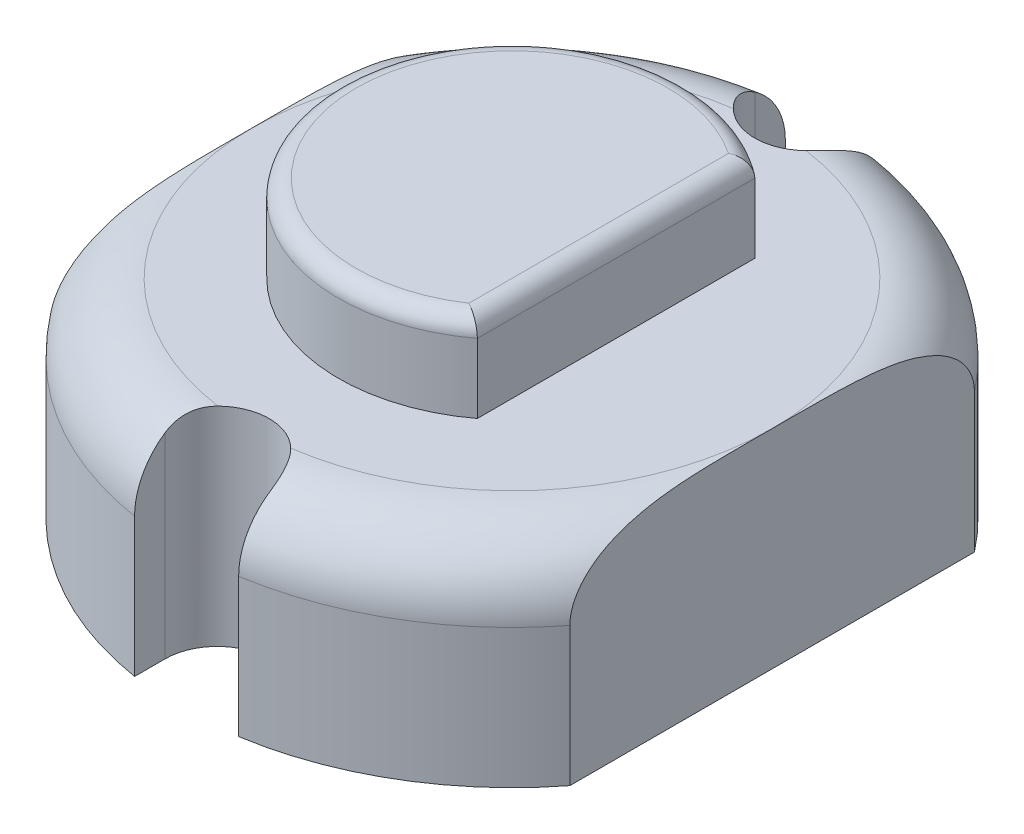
ISO-10303-21;
HEADER;
FILE_DESCRIPTION(('STEP AP214'),'2;1');
FILE_NAME('part.step','',(''),(''),'','','');
FILE_SCHEMA(('AUTOMOTIVE_DESIGN { 1 0 10303 214 1 1 1 1 }'));
ENDSEC;
DATA;
#1=APPLICATION_CONTEXT('core data for automotive mechanical design processes');
#2=APPLICATION_PROTOCOL_DEFINITION('international standard','automotive_design',2000,#1);
#3=PRODUCT_CONTEXT('',#1,'mechanical');
#4=PRODUCT('Part','Part','',(#3));
#5=PRODUCT_RELATED_PRODUCT_CATEGORY('part','',(#4));
#6=PRODUCT_DEFINITION_FORMATION('','',#4);
#7=PRODUCT_DEFINITION_CONTEXT('part definition',#1,'design');
#8=PRODUCT_DEFINITION('design','',#6,#7);
#9=PRODUCT_DEFINITION_SHAPE('','',#8);
#10=(LENGTH_UNIT() NAMED_UNIT(*) SI_UNIT(.MILLI.,.METRE.));
#11=(NAMED_UNIT(*) PLANE_ANGLE_UNIT() SI_UNIT($,.RADIAN.));
#12=(NAMED_UNIT(*) SI_UNIT($,.STERADIAN.) SOLID_ANGLE_UNIT());
#13=UNCERTAINTY_MEASURE_WITH_UNIT(LENGTH_MEASURE(1.E-05),#10,'distance_accuracy_value','');
#14=(GEOMETRIC_REPRESENTATION_CONTEXT(3) GLOBAL_UNCERTAINTY_ASSIGNED_CONTEXT((#13)) GLOBAL_UNIT_ASSIGNED_CONTEXT((#10,
#11,#12)) REPRESENTATION_CONTEXT('',''));
#15=CARTESIAN_POINT('',(0.,0.,0.));
#16=DIRECTION('',(0.,0.,1.));
#17=DIRECTION('',(1.,0.,0.));
#18=AXIS2_PLACEMENT_3D('',#15,#16,#17);
#19=CARTESIAN_POINT('',(0.,0.,0.));
#20=DIRECTION('',(0.,-1.,0.));
#21=DIRECTION('',(0.,0.,-1.));
#22=AXIS2_PLACEMENT_3D('',#19,#20,#21);
#23=CYLINDRICAL_SURFACE('',#22,9.5);
#24=DIRECTION('',(0.,-1.,0.));
#25=VECTOR('',#24,1.);
#26=CARTESIAN_POINT('',(1.5,0.,-9.38083151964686));
#27=LINE('',#26,#25);
#28=CARTESIAN_POINT('',(1.5,3.99999999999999,-9.38083151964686));
#29=VERTEX_POINT('',#28);
#30=CARTESIAN_POINT('',(1.5,0.,-9.38083151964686));
#31=VERTEX_POINT('',#30);
#32=EDGE_CURVE('E711',#29,#31,#27,.T.);
#33=ORIENTED_EDGE('',*,*,#32,.F.);
#34=CARTESIAN_POINT('',(0.,3.99999999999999,0.));
#35=DIRECTION('',(0.,-1.,0.));
#36=DIRECTION('',(0.,0.,-1.));
#37=AXIS2_PLACEMENT_3D('',#34,#35,#36);
#38=CIRCLE('',#37,9.5);
#39=CARTESIAN_POINT('',(7.5,3.99999999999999,-5.8309518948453));
#40=VERTEX_POINT('',#39);
#41=EDGE_CURVE('E576',#29,#40,#38,.T.);
#42=ORIENTED_EDGE('',*,*,#41,.T.);
#43=DIRECTION('',(0.,-1.,0.));
#44=VECTOR('',#43,1.);
#45=CARTESIAN_POINT('',(7.5,0.,-5.8309518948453));
#46=LINE('',#45,#44);
#47=CARTESIAN_POINT('',(7.5,0.,-5.8309518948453));
#48=VERTEX_POINT('',#47);
#49=EDGE_CURVE('E705',#40,#48,#46,.T.);
#50=ORIENTED_EDGE('',*,*,#49,.T.);
#51=CARTESIAN_POINT('',(0.,0.,0.));
#52=DIRECTION('',(0.,-1.,0.));
#53=DIRECTION('',(0.,0.,-1.));
#54=AXIS2_PLACEMENT_3D('',#51,#52,#53);
#55=CIRCLE('',#54,9.5);
#56=EDGE_CURVE('E594',#31,#48,#55,.T.);
#57=ORIENTED_EDGE('',*,*,#56,.F.);
#58=EDGE_LOOP('',(#33,#42,#50,#57));
#59=FACE_BOUND('',#58,.T.);
#60=ADVANCED_FACE('F355',(#59),#23,.T.);
#61=CARTESIAN_POINT('',(0.,4.,0.));
#62=DIRECTION('',(0.,-1.,0.));
#63=DIRECTION('',(0.,0.,-1.));
#64=AXIS2_PLACEMENT_3D('',#61,#62,#63);
#65=TOROIDAL_SURFACE('',#64,7.5,2.);
#66=CARTESIAN_POINT('',(-1.49999998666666,5.64912949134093,-8.5002));
#67=CARTESIAN_POINT('',(-1.50000327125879,5.67016345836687,-8.46907062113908));
#68=CARTESIAN_POINT('',(-1.49903811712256,5.6904060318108,-8.43741482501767));
#69=CARTESIAN_POINT('',(-1.49497747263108,5.72921033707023,-8.37318967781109));
#70=CARTESIAN_POINT('',(-1.49188028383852,5.74777071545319,-8.34061961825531));
#71=CARTESIAN_POINT('',(-1.47908616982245,5.80079864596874,-8.24170015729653));
#72=CARTESIAN_POINT('',(-1.46588522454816,5.83253341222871,-8.17425919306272));
#73=CARTESIAN_POINT('',(-1.42897677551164,5.88789227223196,-8.03848347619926));
#74=CARTESIAN_POINT('',(-1.40521725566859,5.91147517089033,-7.97014594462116));
#75=CARTESIAN_POINT('',(-1.34692449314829,5.94993962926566,-7.83582061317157));
#76=CARTESIAN_POINT('',(-1.31241661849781,5.96484144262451,-7.76982768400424));
#77=CARTESIAN_POINT('',(-1.23615316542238,5.98578410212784,-7.64750971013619));
#78=CARTESIAN_POINT('',(-1.19511517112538,5.99239489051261,-7.59083058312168));
#79=CARTESIAN_POINT('',(-1.10528462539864,5.99985644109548,-7.48351088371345));
#80=CARTESIAN_POINT('',(-1.05648410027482,6.0007012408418,-7.43287661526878));
#81=CARTESIAN_POINT('',(-0.950226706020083,5.99818646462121,-7.33707400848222));
#82=CARTESIAN_POINT('',(-0.892497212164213,5.99465332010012,-7.2922143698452));
#83=CARTESIAN_POINT('',(-0.771283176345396,5.98517098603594,-7.2114213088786));
#84=CARTESIAN_POINT('',(-0.70779612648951,5.97922073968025,-7.17549180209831));
#85=CARTESIAN_POINT('',(-0.567942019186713,5.9662244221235,-7.10925932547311));
#86=CARTESIAN_POINT('',(-0.49096284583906,5.9591351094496,-7.0802488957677));
#87=CARTESIAN_POINT('',(-0.33314535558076,5.94719976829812,-7.03516349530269));
#88=CARTESIAN_POINT('',(-0.25230793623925,5.94235322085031,-7.01908553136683));
#89=CARTESIAN_POINT('',(-0.0874106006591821,5.93659974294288,-7.00021095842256));
#90=CARTESIAN_POINT('',(-0.0033187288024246,5.93576746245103,-6.99766592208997));
#91=CARTESIAN_POINT('',(0.16403241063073,5.93856251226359,-7.00664198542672));
#92=CARTESIAN_POINT('',(0.247291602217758,5.94219024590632,-7.01816435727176));
#93=CARTESIAN_POINT('',(0.407745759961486,5.95236574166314,-7.05421994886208));
#94=CARTESIAN_POINT('',(0.485050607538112,5.95881044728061,-7.07829930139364));
#95=CARTESIAN_POINT('',(0.634787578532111,5.97230897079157,-7.13854377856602));
#96=CARTESIAN_POINT('',(0.707216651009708,5.97936316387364,-7.17471638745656));
#97=CARTESIAN_POINT('',(0.848713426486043,5.99156816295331,-7.26030885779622));
#98=CARTESIAN_POINT('',(0.917465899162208,5.99661462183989,-7.31026876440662));
#99=CARTESIAN_POINT('',(1.04563386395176,6.0009935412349,-7.42119881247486));
#100=CARTESIAN_POINT('',(1.10505860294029,6.00033169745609,-7.48215791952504));
#101=CARTESIAN_POINT('',(1.20886653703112,5.99075174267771,-7.60844868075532));
#102=CARTESIAN_POINT('',(1.25399428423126,5.98239394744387,-7.67320743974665));
#103=CARTESIAN_POINT('',(1.33292398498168,5.95667830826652,-7.80763032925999));
#104=CARTESIAN_POINT('',(1.36673437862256,5.93932719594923,-7.87729075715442));
#105=CARTESIAN_POINT('',(1.41945609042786,5.89770561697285,-8.01040981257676));
#106=CARTESIAN_POINT('',(1.43960725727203,5.87442082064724,-8.07369524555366));
#107=CARTESIAN_POINT('',(1.47101993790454,5.82080428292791,-8.19949711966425));
#108=CARTESIAN_POINT('',(1.48227894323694,5.79047055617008,-8.26201333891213));
#109=CARTESIAN_POINT('',(1.49314028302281,5.74047218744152,-8.35348625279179));
#110=CARTESIAN_POINT('',(1.4957580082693,5.72316261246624,-8.38343679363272));
#111=CARTESIAN_POINT('',(1.49918641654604,5.68716534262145,-8.44247149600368));
#112=CARTESIAN_POINT('',(1.50000296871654,5.66848232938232,-8.47155816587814));
#113=CARTESIAN_POINT('',(1.49999998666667,5.64912949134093,-8.5002));
#114=B_SPLINE_CURVE_WITH_KNOTS('',3,(#66,#67,#68,#69,#70,#71,#72,#73,#74,#75,#76,#77,#78,#79,
#80,#81,#82,#83,#84,#85,#86,#87,#88,#89,#90,#91,#92,#93,#94,#95,#96,#97,#98,#99,#100,#101,#102,
#103,#104,#105,#106,#107,#108,#109,#110,#111,#112,#113),.UNSPECIFIED.,.F.,.F.,(4,2,2,2,2,2,2,2,
2,2,2,2,2,2,2,2,2,2,2,2,2,2,2,4),(0.,0.112663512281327,0.225416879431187,0.451345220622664,
0.678399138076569,0.904921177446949,1.11482221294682,1.32494026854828,1.54366180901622,
1.76247908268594,2.00906334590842,2.25559052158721,2.50668493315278,2.75780205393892,
3.00041435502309,3.24317708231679,3.49728388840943,3.75113717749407,3.98785530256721,
4.22439649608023,4.43459736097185,4.64485750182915,4.74886159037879,4.85252627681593),.UNSPECIFIED.);
#115=CARTESIAN_POINT('',(1.04763285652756,6.,-7.42647058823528));
#116=VERTEX_POINT('',#115);
#117=CARTESIAN_POINT('',(1.5,5.64926461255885,-8.5));
#118=VERTEX_POINT('',#117);
#119=EDGE_CURVE('E507',#116,#118,#114,.T.);
#120=ORIENTED_EDGE('',*,*,#119,.F.);
#121=CARTESIAN_POINT('',(0.,6.,0.));
#122=DIRECTION('',(0.,-1.,0.));
#123=DIRECTION('',(0.,0.,-1.));
#124=AXIS2_PLACEMENT_3D('',#121,#122,#123);
#125=CIRCLE('',#124,7.49999999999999);
#126=CARTESIAN_POINT('',(7.5,6.,0.));
#127=VERTEX_POINT('',#126);
#128=EDGE_CURVE('E556',#116,#127,#125,.T.);
#129=ORIENTED_EDGE('',*,*,#128,.T.);
#130=CARTESIAN_POINT('',(7.5,6.0000000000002,0.));
#131=CARTESIAN_POINT('',(7.5,6.00000012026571,-0.168645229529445));
#132=CARTESIAN_POINT('',(7.5,6.00002435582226,-0.337290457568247));
#133=CARTESIAN_POINT('',(7.5,5.99983036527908,-0.674588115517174));
#134=CARTESIAN_POINT('',(7.5,5.99961212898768,-0.843240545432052));
#135=CARTESIAN_POINT('',(7.5,5.99807624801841,-1.18100400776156));
#136=CARTESIAN_POINT('',(7.5,5.99675559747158,-1.35011503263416));
#137=CARTESIAN_POINT('',(7.5,5.99162700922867,-1.6882953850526));
#138=CARTESIAN_POINT('',(7.5,5.98781925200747,-1.85736471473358));
#139=CARTESIAN_POINT('',(7.5,5.9759495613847,-2.19272713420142));
#140=CARTESIAN_POINT('',(7.5,5.96795497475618,-2.35902235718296));
#141=CARTESIAN_POINT('',(7.5,5.94554290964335,-2.69127574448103));
#142=CARTESIAN_POINT('',(7.5,5.93112307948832,-2.85723376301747));
#143=CARTESIAN_POINT('',(7.5,5.89328095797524,-3.18746730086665));
#144=CARTESIAN_POINT('',(7.5,5.86989603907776,-3.35174693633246));
#145=CARTESIAN_POINT('',(7.5,5.81099583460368,-3.67807384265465));
#146=CARTESIAN_POINT('',(7.5,5.7754938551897,-3.84012336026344));
#147=CARTESIAN_POINT('',(7.5,5.71371392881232,-4.06748234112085));
#148=CARTESIAN_POINT('',(7.5,5.69396226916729,-4.13457756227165));
#149=CARTESIAN_POINT('',(7.5,5.65128682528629,-4.2677861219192));
#150=CARTESIAN_POINT('',(7.5,5.62836191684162,-4.33389910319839));
#151=CARTESIAN_POINT('',(7.5,5.57892249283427,-4.46502273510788));
#152=CARTESIAN_POINT('',(7.5,5.55239678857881,-4.5300292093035));
#153=CARTESIAN_POINT('',(7.5,5.49544887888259,-4.65829638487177));
#154=CARTESIAN_POINT('',(7.5,5.46502706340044,-4.72155726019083));
#155=CARTESIAN_POINT('',(7.5,5.36652860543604,-4.909570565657));
#156=CARTESIAN_POINT('',(7.5,5.29178689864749,-5.0309733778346));
#157=CARTESIAN_POINT('',(7.5,5.12172144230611,-5.25832704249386));
#158=CARTESIAN_POINT('',(7.5,5.02648398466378,-5.3643396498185));
#159=CARTESIAN_POINT('',(7.5,4.85870598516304,-5.51211515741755));
#160=CARTESIAN_POINT('',(7.5,4.79345984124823,-5.5621505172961));
#161=CARTESIAN_POINT('',(7.5,4.65589850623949,-5.65145275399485));
#162=CARTESIAN_POINT('',(7.5,4.58358716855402,-5.69072545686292));
#163=CARTESIAN_POINT('',(7.5,4.43238474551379,-5.75621869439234));
#164=CARTESIAN_POINT('',(7.5,4.35343901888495,-5.78231522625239));
#165=CARTESIAN_POINT('',(7.5,4.19196740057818,-5.81862408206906));
#166=CARTESIAN_POINT('',(7.5,4.10944489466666,-5.82885110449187));
#167=CARTESIAN_POINT('',(7.5,3.95448415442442,-5.83224156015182));
#168=CARTESIAN_POINT('',(7.5,3.88208325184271,-5.82738969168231));
#169=CARTESIAN_POINT('',(7.5,3.73923226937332,-5.80522095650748));
#170=CARTESIAN_POINT('',(7.5,3.66878225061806,-5.78790369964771));
#171=CARTESIAN_POINT('',(7.5,3.53348107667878,-5.7426200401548));
#172=CARTESIAN_POINT('',(7.5,3.46853214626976,-5.71494120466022));
#173=CARTESIAN_POINT('',(7.5,3.3433683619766,-5.65047954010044));
#174=CARTESIAN_POINT('',(7.5,3.28315506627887,-5.61369373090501));
#175=CARTESIAN_POINT('',(7.5,3.1398080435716,-5.51275461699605));
#176=CARTESIAN_POINT('',(7.5,3.05989528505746,-5.44402225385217));
#177=CARTESIAN_POINT('',(7.5,2.91204995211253,-5.29467203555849));
#178=CARTESIAN_POINT('',(7.5,2.84414923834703,-5.21402358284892));
#179=CARTESIAN_POINT('',(7.5,2.68601110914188,-4.9989076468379));
#180=CARTESIAN_POINT('',(7.5,2.60343629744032,-4.85884583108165));
#181=CARTESIAN_POINT('',(7.5,2.46035555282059,-4.568235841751));
#182=CARTESIAN_POINT('',(7.5,2.3998723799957,-4.417677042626));
#183=CARTESIAN_POINT('',(7.5,2.28465533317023,-4.07615386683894));
#184=CARTESIAN_POINT('',(7.5,2.23430690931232,-3.88374515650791));
#185=CARTESIAN_POINT('',(7.5,2.15273555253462,-3.49480380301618));
#186=CARTESIAN_POINT('',(7.5,2.1215507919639,-3.29826373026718));
#187=CARTESIAN_POINT('',(7.5,2.07258048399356,-2.90217133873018));
#188=CARTESIAN_POINT('',(7.5,2.05489411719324,-2.70260750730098));
#189=CARTESIAN_POINT('',(7.5,2.02863920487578,-2.303108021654));
#190=CARTESIAN_POINT('',(7.5,2.02006344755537,-2.10317278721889));
#191=CARTESIAN_POINT('',(7.5,2.00857972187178,-1.71305969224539));
#192=CARTESIAN_POINT('',(7.5,2.00541250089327,-1.52288812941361));
#193=CARTESIAN_POINT('',(7.5,2.00149493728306,-1.14251404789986));
#194=CARTESIAN_POINT('',(7.5,2.0007447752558,-0.952311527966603));
#195=CARTESIAN_POINT('',(7.5,2.00000085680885,-0.571785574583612));
#196=CARTESIAN_POINT('',(7.5,2.00000758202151,-0.381462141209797));
#197=CARTESIAN_POINT('',(7.5,1.99999538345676,-0.000826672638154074));
#198=CARTESIAN_POINT('',(7.5,1.99997646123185,0.18948536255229));
#199=CARTESIAN_POINT('',(7.5,2.00006962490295,0.569731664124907));
#200=CARTESIAN_POINT('',(7.5,2.00018145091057,0.759665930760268));
#201=CARTESIAN_POINT('',(7.5,2.00161166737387,1.13955777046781));
#202=CARTESIAN_POINT('',(7.5,2.00293021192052,1.32951534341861));
#203=CARTESIAN_POINT('',(7.5,2.0086920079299,1.70921337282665));
#204=CARTESIAN_POINT('',(7.5,2.01313229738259,1.89895386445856));
#205=CARTESIAN_POINT('',(7.5,2.02779807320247,2.2781965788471));
#206=CARTESIAN_POINT('',(7.5,2.03802195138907,2.46769885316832));
#207=CARTESIAN_POINT('',(7.5,2.06429563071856,2.80311412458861));
#208=CARTESIAN_POINT('',(7.5,2.07849813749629,2.94916519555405));
#209=CARTESIAN_POINT('',(7.5,2.11430221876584,3.24047019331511));
#210=CARTESIAN_POINT('',(7.5,2.13590751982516,3.38572368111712));
#211=CARTESIAN_POINT('',(7.5,2.18857640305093,3.67368939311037));
#212=CARTESIAN_POINT('',(7.5,2.2195845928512,3.81641145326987));
#213=CARTESIAN_POINT('',(7.5,2.29363251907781,4.0986404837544));
#214=CARTESIAN_POINT('',(7.5,2.33665878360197,4.23815086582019));
#215=CARTESIAN_POINT('',(7.5,2.42954627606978,4.48952662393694));
#216=CARTESIAN_POINT('',(7.5,2.47716811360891,4.60220668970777));
#217=CARTESIAN_POINT('',(7.5,2.58509125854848,4.82175976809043));
#218=CARTESIAN_POINT('',(7.5,2.64541901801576,4.9286200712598));
#219=CARTESIAN_POINT('',(7.5,2.78155261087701,5.13406173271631));
#220=CARTESIAN_POINT('',(7.5,2.85753702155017,5.23252717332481));
#221=CARTESIAN_POINT('',(7.5,3.02610385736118,5.4140182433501));
#222=CARTESIAN_POINT('',(7.5,3.11862444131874,5.49709912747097));
#223=CARTESIAN_POINT('',(7.5,3.28262768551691,5.6137511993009));
#224=CARTESIAN_POINT('',(7.5,3.34918035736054,5.65425503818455));
#225=CARTESIAN_POINT('',(7.5,3.48798892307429,5.72402492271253));
#226=CARTESIAN_POINT('',(7.5,3.56024132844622,5.75329777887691));
#227=CARTESIAN_POINT('',(7.5,3.70937915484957,5.79872088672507));
#228=CARTESIAN_POINT('',(7.5,3.78629357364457,5.81477744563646));
#229=CARTESIAN_POINT('',(7.5,3.94177451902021,5.83204318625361));
#230=CARTESIAN_POINT('',(7.5,4.02034025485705,5.83325931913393));
#231=CARTESIAN_POINT('',(7.5,4.16827786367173,5.82140602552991));
#232=CARTESIAN_POINT('',(7.5,4.23777107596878,5.80977909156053));
#233=CARTESIAN_POINT('',(7.5,4.37389579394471,5.77532138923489));
#234=CARTESIAN_POINT('',(7.5,4.44052697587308,5.75248935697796));
#235=CARTESIAN_POINT('',(7.5,4.57135594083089,5.69622166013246));
#236=CARTESIAN_POINT('',(7.5,4.63543048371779,5.66250268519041));
#237=CARTESIAN_POINT('',(7.5,4.75820427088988,5.58644879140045));
#238=CARTESIAN_POINT('',(7.5,4.81690060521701,5.5441092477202));
#239=CARTESIAN_POINT('',(7.5,4.96094081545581,5.42595198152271));
#240=CARTESIAN_POINT('',(7.5,5.04203190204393,5.34494596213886));
#241=CARTESIAN_POINT('',(7.5,5.19041897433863,5.17113607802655));
#242=CARTESIAN_POINT('',(7.5,5.25767902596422,5.078302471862));
#243=CARTESIAN_POINT('',(7.5,5.36755670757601,4.90413423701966));
#244=CARTESIAN_POINT('',(7.5,5.41241506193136,4.82418222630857));
#245=CARTESIAN_POINT('',(7.5,5.4950063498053,4.66063563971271));
#246=CARTESIAN_POINT('',(7.5,5.53273404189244,4.57703843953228));
#247=CARTESIAN_POINT('',(7.5,5.6018965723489,4.40723921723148));
#248=CARTESIAN_POINT('',(7.5,5.63332676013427,4.32103532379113));
#249=CARTESIAN_POINT('',(7.5,5.69063636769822,4.14688127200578));
#250=CARTESIAN_POINT('',(7.5,5.71651903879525,4.05893216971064));
#251=CARTESIAN_POINT('',(7.5,5.78220317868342,3.81123406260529));
#252=CARTESIAN_POINT('',(7.5,5.8166782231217,3.65007357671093));
#253=CARTESIAN_POINT('',(7.5,5.8738657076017,3.32563556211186));
#254=CARTESIAN_POINT('',(7.5,5.89656622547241,3.16235605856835));
#255=CARTESIAN_POINT('',(7.5,5.93328730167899,2.83420953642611));
#256=CARTESIAN_POINT('',(7.5,5.94727313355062,2.66933879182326));
#257=CARTESIAN_POINT('',(7.5,5.96900285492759,2.33927546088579));
#258=CARTESIAN_POINT('',(7.5,5.97674886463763,2.17408300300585));
#259=CARTESIAN_POINT('',(7.5,5.98823099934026,1.84129125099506));
#260=CARTESIAN_POINT('',(7.5,5.9919103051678,1.67369020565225));
#261=CARTESIAN_POINT('',(7.5,5.99686561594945,1.33844919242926));
#262=CARTESIAN_POINT('',(7.5,5.99814146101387,1.17080922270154));
#263=CARTESIAN_POINT('',(7.5,5.99962534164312,0.835970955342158));
#264=CARTESIAN_POINT('',(7.5,5.99983619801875,0.668772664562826));
#265=CARTESIAN_POINT('',(7.5,6.00002346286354,0.334382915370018));
#266=CARTESIAN_POINT('',(7.5,5.99999988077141,0.167191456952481));
#267=CARTESIAN_POINT('',(7.5,6.0000000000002,0.));
#268=B_SPLINE_CURVE_WITH_KNOTS('',3,(#130,#131,#132,#133,#134,#135,#136,#137,#138,#139,#140,
#141,#142,#143,#144,#145,#146,#147,#148,#149,#150,#151,#152,#153,#154,#155,#156,#157,#158,#159,
#160,#161,#162,#163,#164,#165,#166,#167,#168,#169,#170,#171,#172,#173,#174,#175,#176,#177,#178,
#179,#180,#181,#182,#183,#184,#185,#186,#187,#188,#189,#190,#191,#192,#193,#194,#195,#196,#197,
#198,#199,#200,#201,#202,#203,#204,#205,#206,#207,#208,#209,#210,#211,#212,#213,#214,#215,#216,
#217,#218,#219,#220,#221,#222,#223,#224,#225,#226,#227,#228,#229,#230,#231,#232,#233,#234,#235,
#236,#237,#238,#239,#240,#241,#242,#243,#244,#245,#246,#247,#248,#249,#250,#251,#252,#253,#254,
#255,#256,#257,#258,#259,#260,#261,#262,#263,#264,#265,#266,#267),.UNSPECIFIED.,.T.,.F.,(4,2,2,
2,2,2,2,2,2,2,2,2,2,2,2,2,2,2,2,2,2,2,2,2,2,2,2,2,2,2,2,2,2,2,2,2,2,2,2,2,2,2,2,2,2,2,2,2,2,2,2,
2,2,2,2,2,2,2,2,2,2,2,2,2,2,2,2,2,4),(0.,0.505935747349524,1.01189276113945,1.51923385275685,
2.02653813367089,2.52592209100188,3.0254889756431,3.52299558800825,4.01995761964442,
4.22972035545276,4.43955759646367,4.65006245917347,4.86054626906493,5.28651333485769,
5.71072089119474,5.95655996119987,6.20226568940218,6.4502425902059,6.69798967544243,
6.9145710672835,7.1311592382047,7.34213519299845,7.55318027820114,7.86760684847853,
8.18285528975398,8.66787070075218,9.15338440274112,9.74857826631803,10.3449538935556,
10.945670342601,11.5459109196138,12.1164757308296,12.6870831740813,13.258053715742,
13.8289896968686,14.3987927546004,14.9686685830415,15.5380044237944,16.107182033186,
16.547265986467,16.9875718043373,17.4253325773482,17.8626045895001,18.2289765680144,
18.5961189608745,18.9677070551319,19.3379335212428,19.5708026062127,19.8035302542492,
20.0378938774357,20.2721477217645,20.4825407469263,20.6929575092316,20.909363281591,
21.1258854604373,21.4677964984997,21.8105849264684,22.0852311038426,22.3600783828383,
22.6351278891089,22.910015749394,23.40377591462,23.8980350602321,24.3942513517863,
24.8902989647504,25.3931929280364,25.896120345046,26.3977149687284,26.8992893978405),.UNSPECIFIED.);
#269=EDGE_CURVE('E703',#127,#40,#268,.T.);
#270=ORIENTED_EDGE('',*,*,#269,.T.);
#271=ORIENTED_EDGE('',*,*,#41,.F.);
#272=CARTESIAN_POINT('',(1.5,4.26528819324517,-9.3629340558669));
#273=CARTESIAN_POINT('',(1.5,4.15523062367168,-9.37784542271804));
#274=CARTESIAN_POINT('',(1.5,4.04383297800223,-9.3834661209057));
#275=CARTESIAN_POINT('',(1.5,3.82158766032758,-9.37590356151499));
#276=CARTESIAN_POINT('',(1.5,3.71074079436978,-9.36269806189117));
#277=CARTESIAN_POINT('',(1.5,3.49289616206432,-9.31786757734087));
#278=CARTESIAN_POINT('',(1.5,3.38589616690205,-9.2862534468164));
#279=CARTESIAN_POINT('',(1.5,3.17873080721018,-9.20556756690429));
#280=CARTESIAN_POINT('',(1.5,3.0785638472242,-9.15649990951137));
#281=CARTESIAN_POINT('',(1.5,2.88752714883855,-9.04218865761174));
#282=CARTESIAN_POINT('',(1.5,2.79668598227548,-8.97689733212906));
#283=CARTESIAN_POINT('',(1.5,2.62711768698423,-8.83212602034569));
#284=CARTESIAN_POINT('',(1.5,2.5483914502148,-8.75264499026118));
#285=CARTESIAN_POINT('',(1.5,2.40443159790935,-8.58093537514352));
#286=CARTESIAN_POINT('',(1.5,2.33933916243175,-8.48858846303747));
#287=CARTESIAN_POINT('',(1.5,2.22532370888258,-8.29440537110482));
#288=CARTESIAN_POINT('',(1.5,2.17640176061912,-8.19256856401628));
#289=CARTESIAN_POINT('',(1.5,2.09533748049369,-7.98071106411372));
#290=CARTESIAN_POINT('',(1.5,2.06345128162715,-7.87059238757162));
#291=CARTESIAN_POINT('',(1.5,2.0182940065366,-7.64660434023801));
#292=CARTESIAN_POINT('',(1.5,2.00502451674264,-7.53273465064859));
#293=CARTESIAN_POINT('',(1.5,1.99727190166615,-7.30250634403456));
#294=CARTESIAN_POINT('',(1.5,2.00309706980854,-7.18613731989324));
#295=CARTESIAN_POINT('',(1.5,2.03395697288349,-6.95597178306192));
#296=CARTESIAN_POINT('',(1.5,2.05899340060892,-6.84217549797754));
#297=CARTESIAN_POINT('',(1.5,2.12796719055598,-6.61897248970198));
#298=CARTESIAN_POINT('',(1.5,2.17212562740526,-6.5096340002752));
#299=CARTESIAN_POINT('',(1.5,2.27818793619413,-6.29992051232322));
#300=CARTESIAN_POINT('',(1.5,2.34009253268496,-6.19954587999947));
#301=CARTESIAN_POINT('',(1.5,2.47993344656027,-6.01084363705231));
#302=CARTESIAN_POINT('',(1.5,2.55784978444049,-5.92250123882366));
#303=CARTESIAN_POINT('',(1.5,2.72769487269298,-5.76049080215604));
#304=CARTESIAN_POINT('',(1.5,2.81962222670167,-5.68682130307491));
#305=CARTESIAN_POINT('',(1.5,3.01286583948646,-5.55804467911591));
#306=CARTESIAN_POINT('',(1.5,3.1139413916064,-5.50257673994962));
#307=CARTESIAN_POINT('',(1.5,3.32420881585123,-5.41009307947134));
#308=CARTESIAN_POINT('',(1.5,3.43339871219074,-5.37307288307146));
#309=CARTESIAN_POINT('',(1.5,3.65277770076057,-5.31983932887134));
#310=CARTESIAN_POINT('',(1.5,3.76280467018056,-5.30295716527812));
#311=CARTESIAN_POINT('',(1.5,3.98411563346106,-5.2883778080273));
#312=CARTESIAN_POINT('',(1.5,4.09539942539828,-5.29067757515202));
#313=CARTESIAN_POINT('',(1.5,4.31342994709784,-5.31409814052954));
#314=CARTESIAN_POINT('',(1.5,4.42022247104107,-5.33479626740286));
#315=CARTESIAN_POINT('',(1.5,4.62886517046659,-5.39367676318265));
#316=CARTESIAN_POINT('',(1.5,4.73071518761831,-5.43185969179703));
#317=CARTESIAN_POINT('',(1.5,4.92762612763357,-5.52481170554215));
#318=CARTESIAN_POINT('',(1.5,5.02261941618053,-5.57972379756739));
#319=CARTESIAN_POINT('',(1.5,5.2024150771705,-5.70425217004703));
#320=CARTESIAN_POINT('',(1.5,5.28721595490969,-5.77387060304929));
#321=CARTESIAN_POINT('',(1.5,5.4470660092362,-5.92815979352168));
#322=CARTESIAN_POINT('',(1.5,5.52172482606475,-6.0132349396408));
#323=CARTESIAN_POINT('',(1.5,5.65620519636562,-6.19439857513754));
#324=CARTESIAN_POINT('',(1.5,5.71602442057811,-6.29048879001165));
#325=CARTESIAN_POINT('',(1.5,5.82091755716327,-6.49407254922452));
#326=CARTESIAN_POINT('',(1.5,5.86549682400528,-6.60182123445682));
#327=CARTESIAN_POINT('',(1.5,5.93619219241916,-6.82321832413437));
#328=CARTESIAN_POINT('',(1.5,5.96230668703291,-6.93686724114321));
#329=CARTESIAN_POINT('',(1.5,5.99552844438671,-7.16837009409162));
#330=CARTESIAN_POINT('',(1.5,6.00239411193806,-7.2862588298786));
#331=CARTESIAN_POINT('',(1.5,5.99613119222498,-7.52150917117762));
#332=CARTESIAN_POINT('',(1.5,5.98300276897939,-7.63887078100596));
#333=CARTESIAN_POINT('',(1.5,5.93710783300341,-7.86906564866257));
#334=CARTESIAN_POINT('',(1.5,5.90444308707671,-7.98191916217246));
#335=CARTESIAN_POINT('',(1.5,5.82034902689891,-8.20040350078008));
#336=CARTESIAN_POINT('',(1.5,5.76892178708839,-8.30603512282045));
#337=CARTESIAN_POINT('',(1.5,5.64956557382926,-8.50539187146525));
#338=CARTESIAN_POINT('',(1.5,5.58189326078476,-8.59927064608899));
#339=CARTESIAN_POINT('',(1.5,5.43148659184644,-8.77411728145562));
#340=CARTESIAN_POINT('',(1.5,5.34874975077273,-8.85508300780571));
#341=CARTESIAN_POINT('',(1.5,5.17200227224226,-9.00041856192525));
#342=CARTESIAN_POINT('',(1.5,5.07819014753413,-9.06503012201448));
#343=CARTESIAN_POINT('',(1.5,4.88101083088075,-9.17727494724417));
#344=CARTESIAN_POINT('',(1.5,4.77765632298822,-9.22493035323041));
#345=CARTESIAN_POINT('',(1.5,4.60543207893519,-9.28708317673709));
#346=CARTESIAN_POINT('',(1.5,4.53856414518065,-9.30728590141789));
#347=CARTESIAN_POINT('',(1.5,4.40306989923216,-9.34052648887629));
#348=CARTESIAN_POINT('',(1.5,4.3344435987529,-9.35356439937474));
#349=CARTESIAN_POINT('',(1.5,4.26528819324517,-9.3629340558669));
#350=B_SPLINE_CURVE_WITH_KNOTS('',3,(#272,#273,#274,#275,#276,#277,#278,#279,#280,#281,#282,
#283,#284,#285,#286,#287,#288,#289,#290,#291,#292,#293,#294,#295,#296,#297,#298,#299,#300,#301,
#302,#303,#304,#305,#306,#307,#308,#309,#310,#311,#312,#313,#314,#315,#316,#317,#318,#319,#320,
#321,#322,#323,#324,#325,#326,#327,#328,#329,#330,#331,#332,#333,#334,#335,#336,#337,#338,#339,
#340,#341,#342,#343,#344,#345,#346,#347,#348,#349),.UNSPECIFIED.,.T.,.F.,(4,2,2,2,2,2,2,2,2,2,2,
2,2,2,2,2,2,2,2,2,2,2,2,2,2,2,2,2,2,2,2,2,2,2,2,2,2,2,4),(0.,0.332933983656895,
0.666261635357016,0.999392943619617,1.33244620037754,1.66649116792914,2.00056071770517,
2.33793505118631,2.67533170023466,3.01766772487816,3.3600329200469,3.70795283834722,
4.05590341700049,4.40798888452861,4.76008872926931,5.11175186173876,5.46337996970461,
5.80754440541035,6.15162531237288,6.48392900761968,6.81618005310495,7.14098996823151,
7.46581028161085,7.79348912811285,8.12121596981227,8.45924530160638,8.79732765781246,
9.14552387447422,9.49375039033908,9.84632839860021,10.1989035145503,10.549657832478,
10.9003733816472,11.2458755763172,11.5914348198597,11.9315408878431,12.2712012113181,
12.4804038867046,12.6896051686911),.UNSPECIFIED.);
#351=EDGE_CURVE('E12',#118,#29,#350,.T.);
#352=ORIENTED_EDGE('',*,*,#351,.F.);
#353=EDGE_LOOP('',(#120,#129,#270,#271,#352));
#354=FACE_BOUND('',#353,.T.);
#355=ADVANCED_FACE('F554',(#354),#65,.T.);
#356=DIRECTION('',(0.,-1.,0.));
#357=VECTOR('',#356,1.);
#358=CARTESIAN_POINT('',(-1.5,0.,9.38083151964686));
#359=LINE('',#358,#357);
#360=CARTESIAN_POINT('',(-1.5,3.99999999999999,9.38083151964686));
#361=VERTEX_POINT('',#360);
#362=CARTESIAN_POINT('',(-1.5,0.,9.38083151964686));
#363=VERTEX_POINT('',#362);
#364=EDGE_CURVE('E636',#361,#363,#359,.T.);
#365=ORIENTED_EDGE('',*,*,#364,.F.);
#366=CARTESIAN_POINT('',(-7.5,3.99999999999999,5.8309518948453));
#367=VERTEX_POINT('',#366);
#368=EDGE_CURVE('E572',#361,#367,#38,.T.);
#369=ORIENTED_EDGE('',*,*,#368,.T.);
#370=DIRECTION('',(0.,-1.,0.));
#371=VECTOR('',#370,1.);
#372=CARTESIAN_POINT('',(-7.5,0.,5.8309518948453));
#373=LINE('',#372,#371);
#374=CARTESIAN_POINT('',(-7.5,0.,5.8309518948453));
#375=VERTEX_POINT('',#374);
#376=EDGE_CURVE('E684',#367,#375,#373,.T.);
#377=ORIENTED_EDGE('',*,*,#376,.T.);
#378=EDGE_CURVE('E590',#363,#375,#55,.T.);
#379=ORIENTED_EDGE('',*,*,#378,.F.);
#380=EDGE_LOOP('',(#365,#369,#377,#379));
#381=FACE_BOUND('',#380,.T.);
#382=ADVANCED_FACE('F719',(#381),#23,.T.);
#383=CARTESIAN_POINT('',(1.49999998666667,5.64912949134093,8.5002));
#384=CARTESIAN_POINT('',(1.5000032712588,5.67016345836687,8.46907062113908));
#385=CARTESIAN_POINT('',(1.49903811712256,5.6904060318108,8.43741482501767));
#386=CARTESIAN_POINT('',(1.49497747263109,5.72921033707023,8.37318967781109));
#387=CARTESIAN_POINT('',(1.49188028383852,5.74777071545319,8.34061961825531));
#388=CARTESIAN_POINT('',(1.47908616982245,5.80079864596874,8.24170015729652));
#389=CARTESIAN_POINT('',(1.46588522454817,5.83253341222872,8.17425919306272));
#390=CARTESIAN_POINT('',(1.42897677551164,5.88789227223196,8.03848347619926));
#391=CARTESIAN_POINT('',(1.40521725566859,5.91147517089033,7.97014594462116));
#392=CARTESIAN_POINT('',(1.34692449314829,5.94993962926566,7.83582061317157));
#393=CARTESIAN_POINT('',(1.31241661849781,5.96484144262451,7.76982768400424));
#394=CARTESIAN_POINT('',(1.23615316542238,5.98578410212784,7.64750971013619));
#395=CARTESIAN_POINT('',(1.19511517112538,5.99239489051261,7.59083058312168));
#396=CARTESIAN_POINT('',(1.10528462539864,5.99985644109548,7.48351088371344));
#397=CARTESIAN_POINT('',(1.05648410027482,6.0007012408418,7.43287661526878));
#398=CARTESIAN_POINT('',(0.950226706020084,5.99818646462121,7.33707400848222));
#399=CARTESIAN_POINT('',(0.892497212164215,5.99465332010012,7.2922143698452));
#400=CARTESIAN_POINT('',(0.771283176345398,5.98517098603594,7.2114213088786));
#401=CARTESIAN_POINT('',(0.707796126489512,5.97922073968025,7.17549180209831));
#402=CARTESIAN_POINT('',(0.567942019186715,5.9662244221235,7.10925932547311));
#403=CARTESIAN_POINT('',(0.490962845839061,5.9591351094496,7.0802488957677));
#404=CARTESIAN_POINT('',(0.333145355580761,5.94719976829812,7.03516349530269));
#405=CARTESIAN_POINT('',(0.252307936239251,5.94235322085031,7.01908553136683));
#406=CARTESIAN_POINT('',(0.0874106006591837,5.93659974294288,7.00021095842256));
#407=CARTESIAN_POINT('',(0.00331872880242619,5.93576746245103,6.99766592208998));
#408=CARTESIAN_POINT('',(-0.164032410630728,5.93856251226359,7.00664198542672));
#409=CARTESIAN_POINT('',(-0.247291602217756,5.94219024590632,7.01816435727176));
#410=CARTESIAN_POINT('',(-0.407745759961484,5.95236574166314,7.05421994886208));
#411=CARTESIAN_POINT('',(-0.48505060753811,5.95881044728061,7.07829930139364));
#412=CARTESIAN_POINT('',(-0.634787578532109,5.97230897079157,7.13854377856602));
#413=CARTESIAN_POINT('',(-0.707216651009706,5.97936316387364,7.17471638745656));
#414=CARTESIAN_POINT('',(-0.848713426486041,5.99156816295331,7.26030885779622));
#415=CARTESIAN_POINT('',(-0.917465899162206,5.99661462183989,7.31026876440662));
#416=CARTESIAN_POINT('',(-1.04563386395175,6.0009935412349,7.42119881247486));
#417=CARTESIAN_POINT('',(-1.10505860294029,6.00033169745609,7.48215791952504));
#418=CARTESIAN_POINT('',(-1.20886653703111,5.99075174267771,7.60844868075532));
#419=CARTESIAN_POINT('',(-1.25399428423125,5.98239394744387,7.67320743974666));
#420=CARTESIAN_POINT('',(-1.33292398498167,5.95667830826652,7.80763032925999));
#421=CARTESIAN_POINT('',(-1.36673437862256,5.93932719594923,7.87729075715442));
#422=CARTESIAN_POINT('',(-1.41945609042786,5.89770561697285,8.01040981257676));
#423=CARTESIAN_POINT('',(-1.43960725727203,5.87442082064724,8.07369524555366));
#424=CARTESIAN_POINT('',(-1.47101993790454,5.82080428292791,8.19949711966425));
#425=CARTESIAN_POINT('',(-1.48227894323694,5.79047055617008,8.26201333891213));
#426=CARTESIAN_POINT('',(-1.49314028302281,5.74047218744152,8.35348625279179));
#427=CARTESIAN_POINT('',(-1.49575800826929,5.72316261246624,8.38343679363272));
#428=CARTESIAN_POINT('',(-1.49918641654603,5.68716534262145,8.44247149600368));
#429=CARTESIAN_POINT('',(-1.50000296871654,5.66848232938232,8.47155816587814));
#430=CARTESIAN_POINT('',(-1.49999998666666,5.64912949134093,8.5002));
#431=B_SPLINE_CURVE_WITH_KNOTS('',3,(#383,#384,#385,#386,#387,#388,#389,#390,#391,#392,#393,
#394,#395,#396,#397,#398,#399,#400,#401,#402,#403,#404,#405,#406,#407,#408,#409,#410,#411,#412,
#413,#414,#415,#416,#417,#418,#419,#420,#421,#422,#423,#424,#425,#426,#427,#428,#429,#430),
.UNSPECIFIED.,.F.,.F.,(4,2,2,2,2,2,2,2,2,2,2,2,2,2,2,2,2,2,2,2,2,2,2,4),(0.,0.112663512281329,
0.225416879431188,0.451345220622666,0.678399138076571,0.904921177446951,1.11482221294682,
1.32494026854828,1.54366180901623,1.76247908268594,2.00906334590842,2.25559052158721,
2.50668493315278,2.75780205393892,3.00041435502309,3.24317708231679,3.49728388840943,
3.75113717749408,3.98785530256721,4.22439649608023,4.43459736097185,4.64485750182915,
4.74886159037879,4.85252627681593),.UNSPECIFIED.);
#432=CARTESIAN_POINT('',(-1.04763285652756,6.,7.42647058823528));
#433=VERTEX_POINT('',#432);
#434=CARTESIAN_POINT('',(-1.5,5.64926461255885,8.5));
#435=VERTEX_POINT('',#434);
#436=EDGE_CURVE('E634',#433,#435,#431,.T.);
#437=ORIENTED_EDGE('',*,*,#436,.F.);
#438=CARTESIAN_POINT('',(-7.5,6.,0.));
#439=VERTEX_POINT('',#438);
#440=EDGE_CURVE('E567',#433,#439,#125,.T.);
#441=ORIENTED_EDGE('',*,*,#440,.T.);
#442=CARTESIAN_POINT('',(-7.5,6.0000000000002,0.));
#443=CARTESIAN_POINT('',(-7.5,6.00000012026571,0.168645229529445));
#444=CARTESIAN_POINT('',(-7.5,6.00002435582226,0.337290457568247));
#445=CARTESIAN_POINT('',(-7.5,5.99983036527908,0.674588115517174));
#446=CARTESIAN_POINT('',(-7.5,5.99961212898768,0.843240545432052));
#447=CARTESIAN_POINT('',(-7.5,5.99807624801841,1.18100400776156));
#448=CARTESIAN_POINT('',(-7.5,5.99675559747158,1.35011503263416));
#449=CARTESIAN_POINT('',(-7.5,5.99162700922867,1.6882953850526));
#450=CARTESIAN_POINT('',(-7.5,5.98781925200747,1.85736471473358));
#451=CARTESIAN_POINT('',(-7.5,5.9759495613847,2.19272713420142));
#452=CARTESIAN_POINT('',(-7.5,5.96795497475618,2.35902235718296));
#453=CARTESIAN_POINT('',(-7.5,5.94554290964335,2.69127574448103));
#454=CARTESIAN_POINT('',(-7.5,5.93112307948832,2.85723376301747));
#455=CARTESIAN_POINT('',(-7.5,5.89328095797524,3.18746730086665));
#456=CARTESIAN_POINT('',(-7.5,5.86989603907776,3.35174693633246));
#457=CARTESIAN_POINT('',(-7.5,5.81099583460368,3.67807384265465));
#458=CARTESIAN_POINT('',(-7.5,5.7754938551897,3.84012336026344));
#459=CARTESIAN_POINT('',(-7.5,5.71371392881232,4.06748234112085));
#460=CARTESIAN_POINT('',(-7.5,5.69396226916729,4.13457756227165));
#461=CARTESIAN_POINT('',(-7.5,5.65128682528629,4.2677861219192));
#462=CARTESIAN_POINT('',(-7.5,5.62836191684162,4.33389910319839));
#463=CARTESIAN_POINT('',(-7.5,5.57892249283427,4.46502273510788));
#464=CARTESIAN_POINT('',(-7.5,5.55239678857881,4.5300292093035));
#465=CARTESIAN_POINT('',(-7.5,5.49544887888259,4.65829638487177));
#466=CARTESIAN_POINT('',(-7.5,5.46502706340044,4.72155726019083));
#467=CARTESIAN_POINT('',(-7.5,5.36652860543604,4.909570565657));
#468=CARTESIAN_POINT('',(-7.5,5.29178689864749,5.0309733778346));
#469=CARTESIAN_POINT('',(-7.5,5.12172144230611,5.25832704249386));
#470=CARTESIAN_POINT('',(-7.5,5.02648398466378,5.3643396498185));
#471=CARTESIAN_POINT('',(-7.5,4.85870598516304,5.51211515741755));
#472=CARTESIAN_POINT('',(-7.5,4.79345984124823,5.5621505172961));
#473=CARTESIAN_POINT('',(-7.5,4.65589850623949,5.65145275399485));
#474=CARTESIAN_POINT('',(-7.5,4.58358716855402,5.69072545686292));
#475=CARTESIAN_POINT('',(-7.5,4.43238474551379,5.75621869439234));
#476=CARTESIAN_POINT('',(-7.5,4.35343901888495,5.78231522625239));
#477=CARTESIAN_POINT('',(-7.5,4.19196740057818,5.81862408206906));
#478=CARTESIAN_POINT('',(-7.5,4.10944489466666,5.82885110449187));
#479=CARTESIAN_POINT('',(-7.5,3.95448415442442,5.83224156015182));
#480=CARTESIAN_POINT('',(-7.5,3.88208325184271,5.82738969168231));
#481=CARTESIAN_POINT('',(-7.5,3.73923226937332,5.80522095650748));
#482=CARTESIAN_POINT('',(-7.5,3.66878225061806,5.78790369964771));
#483=CARTESIAN_POINT('',(-7.5,3.53348107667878,5.7426200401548));
#484=CARTESIAN_POINT('',(-7.5,3.46853214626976,5.71494120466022));
#485=CARTESIAN_POINT('',(-7.5,3.3433683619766,5.65047954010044));
#486=CARTESIAN_POINT('',(-7.5,3.28315506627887,5.61369373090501));
#487=CARTESIAN_POINT('',(-7.5,3.1398080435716,5.51275461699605));
#488=CARTESIAN_POINT('',(-7.5,3.05989528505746,5.44402225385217));
#489=CARTESIAN_POINT('',(-7.5,2.91204995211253,5.29467203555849));
#490=CARTESIAN_POINT('',(-7.5,2.84414923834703,5.21402358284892));
#491=CARTESIAN_POINT('',(-7.5,2.68601110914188,4.9989076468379));
#492=CARTESIAN_POINT('',(-7.5,2.60343629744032,4.85884583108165));
#493=CARTESIAN_POINT('',(-7.5,2.46035555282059,4.568235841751));
#494=CARTESIAN_POINT('',(-7.5,2.3998723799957,4.417677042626));
#495=CARTESIAN_POINT('',(-7.5,2.28465533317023,4.07615386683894));
#496=CARTESIAN_POINT('',(-7.5,2.23430690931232,3.88374515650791));
#497=CARTESIAN_POINT('',(-7.5,2.15273555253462,3.49480380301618));
#498=CARTESIAN_POINT('',(-7.5,2.1215507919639,3.29826373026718));
#499=CARTESIAN_POINT('',(-7.5,2.07258048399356,2.90217133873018));
#500=CARTESIAN_POINT('',(-7.5,2.05489411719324,2.70260750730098));
#501=CARTESIAN_POINT('',(-7.5,2.02863920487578,2.303108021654));
#502=CARTESIAN_POINT('',(-7.5,2.02006344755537,2.10317278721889));
#503=CARTESIAN_POINT('',(-7.5,2.00857972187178,1.71305969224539));
#504=CARTESIAN_POINT('',(-7.5,2.00541250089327,1.52288812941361));
#505=CARTESIAN_POINT('',(-7.5,2.00149493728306,1.14251404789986));
#506=CARTESIAN_POINT('',(-7.5,2.0007447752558,0.952311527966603));
#507=CARTESIAN_POINT('',(-7.5,2.00000085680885,0.571785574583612));
#508=CARTESIAN_POINT('',(-7.5,2.00000758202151,0.381462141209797));
#509=CARTESIAN_POINT('',(-7.5,1.99999538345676,0.000826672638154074));
#510=CARTESIAN_POINT('',(-7.5,1.99997646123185,-0.18948536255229));
#511=CARTESIAN_POINT('',(-7.5,2.00006962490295,-0.569731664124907));
#512=CARTESIAN_POINT('',(-7.5,2.00018145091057,-0.759665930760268));
#513=CARTESIAN_POINT('',(-7.5,2.00161166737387,-1.13955777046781));
#514=CARTESIAN_POINT('',(-7.5,2.00293021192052,-1.32951534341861));
#515=CARTESIAN_POINT('',(-7.5,2.0086920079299,-1.70921337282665));
#516=CARTESIAN_POINT('',(-7.5,2.01313229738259,-1.89895386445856));
#517=CARTESIAN_POINT('',(-7.5,2.02779807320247,-2.2781965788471));
#518=CARTESIAN_POINT('',(-7.5,2.03802195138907,-2.46769885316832));
#519=CARTESIAN_POINT('',(-7.5,2.06429563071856,-2.80311412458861));
#520=CARTESIAN_POINT('',(-7.5,2.07849813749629,-2.94916519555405));
#521=CARTESIAN_POINT('',(-7.5,2.11430221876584,-3.24047019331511));
#522=CARTESIAN_POINT('',(-7.5,2.13590751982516,-3.38572368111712));
#523=CARTESIAN_POINT('',(-7.5,2.18857640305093,-3.67368939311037));
#524=CARTESIAN_POINT('',(-7.5,2.2195845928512,-3.81641145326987));
#525=CARTESIAN_POINT('',(-7.5,2.29363251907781,-4.0986404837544));
#526=CARTESIAN_POINT('',(-7.5,2.33665878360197,-4.23815086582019));
#527=CARTESIAN_POINT('',(-7.5,2.42954627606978,-4.48952662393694));
#528=CARTESIAN_POINT('',(-7.5,2.47716811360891,-4.60220668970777));
#529=CARTESIAN_POINT('',(-7.5,2.58509125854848,-4.82175976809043));
#530=CARTESIAN_POINT('',(-7.5,2.64541901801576,-4.9286200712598));
#531=CARTESIAN_POINT('',(-7.5,2.78155261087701,-5.13406173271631));
#532=CARTESIAN_POINT('',(-7.5,2.85753702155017,-5.23252717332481));
#533=CARTESIAN_POINT('',(-7.5,3.02610385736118,-5.4140182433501));
#534=CARTESIAN_POINT('',(-7.5,3.11862444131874,-5.49709912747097));
#535=CARTESIAN_POINT('',(-7.5,3.28262768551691,-5.6137511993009));
#536=CARTESIAN_POINT('',(-7.5,3.34918035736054,-5.65425503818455));
#537=CARTESIAN_POINT('',(-7.5,3.48798892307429,-5.72402492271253));
#538=CARTESIAN_POINT('',(-7.5,3.56024132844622,-5.75329777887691));
#539=CARTESIAN_POINT('',(-7.5,3.70937915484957,-5.79872088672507));
#540=CARTESIAN_POINT('',(-7.5,3.78629357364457,-5.81477744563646));
#541=CARTESIAN_POINT('',(-7.5,3.94177451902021,-5.83204318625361));
#542=CARTESIAN_POINT('',(-7.5,4.02034025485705,-5.83325931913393));
#543=CARTESIAN_POINT('',(-7.5,4.16827786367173,-5.82140602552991));
#544=CARTESIAN_POINT('',(-7.5,4.23777107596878,-5.80977909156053));
#545=CARTESIAN_POINT('',(-7.5,4.37389579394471,-5.77532138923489));
#546=CARTESIAN_POINT('',(-7.5,4.44052697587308,-5.75248935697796));
#547=CARTESIAN_POINT('',(-7.5,4.57135594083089,-5.69622166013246));
#548=CARTESIAN_POINT('',(-7.5,4.63543048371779,-5.66250268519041));
#549=CARTESIAN_POINT('',(-7.5,4.75820427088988,-5.58644879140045));
#550=CARTESIAN_POINT('',(-7.5,4.81690060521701,-5.5441092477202));
#551=CARTESIAN_POINT('',(-7.5,4.96094081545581,-5.42595198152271));
#552=CARTESIAN_POINT('',(-7.5,5.04203190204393,-5.34494596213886));
#553=CARTESIAN_POINT('',(-7.5,5.19041897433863,-5.17113607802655));
#554=CARTESIAN_POINT('',(-7.5,5.25767902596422,-5.078302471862));
#555=CARTESIAN_POINT('',(-7.5,5.36755670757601,-4.90413423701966));
#556=CARTESIAN_POINT('',(-7.5,5.41241506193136,-4.82418222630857));
#557=CARTESIAN_POINT('',(-7.5,5.4950063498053,-4.66063563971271));
#558=CARTESIAN_POINT('',(-7.5,5.53273404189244,-4.57703843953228));
#559=CARTESIAN_POINT('',(-7.5,5.6018965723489,-4.40723921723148));
#560=CARTESIAN_POINT('',(-7.5,5.63332676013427,-4.32103532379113));
#561=CARTESIAN_POINT('',(-7.5,5.69063636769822,-4.14688127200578));
#562=CARTESIAN_POINT('',(-7.5,5.71651903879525,-4.05893216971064));
#563=CARTESIAN_POINT('',(-7.5,5.78220317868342,-3.81123406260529));
#564=CARTESIAN_POINT('',(-7.5,5.8166782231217,-3.65007357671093));
#565=CARTESIAN_POINT('',(-7.5,5.8738657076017,-3.32563556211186));
#566=CARTESIAN_POINT('',(-7.5,5.89656622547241,-3.16235605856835));
#567=CARTESIAN_POINT('',(-7.5,5.93328730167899,-2.83420953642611));
#568=CARTESIAN_POINT('',(-7.5,5.94727313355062,-2.66933879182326));
#569=CARTESIAN_POINT('',(-7.5,5.96900285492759,-2.33927546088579));
#570=CARTESIAN_POINT('',(-7.5,5.97674886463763,-2.17408300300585));
#571=CARTESIAN_POINT('',(-7.5,5.98823099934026,-1.84129125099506));
#572=CARTESIAN_POINT('',(-7.5,5.9919103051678,-1.67369020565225));
#573=CARTESIAN_POINT('',(-7.5,5.99686561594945,-1.33844919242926));
#574=CARTESIAN_POINT('',(-7.5,5.99814146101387,-1.17080922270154));
#575=CARTESIAN_POINT('',(-7.5,5.99962534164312,-0.835970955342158));
#576=CARTESIAN_POINT('',(-7.5,5.99983619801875,-0.668772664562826));
#577=CARTESIAN_POINT('',(-7.5,6.00002346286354,-0.334382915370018));
#578=CARTESIAN_POINT('',(-7.5,5.99999988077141,-0.167191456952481));
#579=CARTESIAN_POINT('',(-7.5,6.0000000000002,0.));
#580=B_SPLINE_CURVE_WITH_KNOTS('',3,(#442,#443,#444,#445,#446,#447,#448,#449,#450,#451,#452,
#453,#454,#455,#456,#457,#458,#459,#460,#461,#462,#463,#464,#465,#466,#467,#468,#469,#470,#471,
#472,#473,#474,#475,#476,#477,#478,#479,#480,#481,#482,#483,#484,#485,#486,#487,#488,#489,#490,
#491,#492,#493,#494,#495,#496,#497,#498,#499,#500,#501,#502,#503,#504,#505,#506,#507,#508,#509,
#510,#511,#512,#513,#514,#515,#516,#517,#518,#519,#520,#521,#522,#523,#524,#525,#526,#527,#528,
#529,#530,#531,#532,#533,#534,#535,#536,#537,#538,#539,#540,#541,#542,#543,#544,#545,#546,#547,
#548,#549,#550,#551,#552,#553,#554,#555,#556,#557,#558,#559,#560,#561,#562,#563,#564,#565,#566,
#567,#568,#569,#570,#571,#572,#573,#574,#575,#576,#577,#578,#579),.UNSPECIFIED.,.T.,.F.,(4,2,2,
2,2,2,2,2,2,2,2,2,2,2,2,2,2,2,2,2,2,2,2,2,2,2,2,2,2,2,2,2,2,2,2,2,2,2,2,2,2,2,2,2,2,2,2,2,2,2,2,
2,2,2,2,2,2,2,2,2,2,2,2,2,2,2,2,2,4),(0.,0.505935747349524,1.01189276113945,1.51923385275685,
2.02653813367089,2.52592209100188,3.0254889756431,3.52299558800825,4.01995761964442,
4.22972035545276,4.43955759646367,4.65006245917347,4.86054626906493,5.28651333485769,
5.71072089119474,5.95655996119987,6.20226568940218,6.4502425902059,6.69798967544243,
6.9145710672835,7.1311592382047,7.34213519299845,7.55318027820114,7.86760684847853,
8.18285528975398,8.66787070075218,9.15338440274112,9.74857826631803,10.3449538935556,
10.945670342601,11.5459109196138,12.1164757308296,12.6870831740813,13.258053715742,
13.8289896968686,14.3987927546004,14.9686685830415,15.5380044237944,16.107182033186,
16.547265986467,16.9875718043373,17.4253325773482,17.8626045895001,18.2289765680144,
18.5961189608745,18.9677070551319,19.3379335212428,19.5708026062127,19.8035302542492,
20.0378938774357,20.2721477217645,20.4825407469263,20.6929575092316,20.909363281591,
21.1258854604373,21.4677964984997,21.8105849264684,22.0852311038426,22.3600783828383,
22.6351278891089,22.910015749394,23.40377591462,23.8980350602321,24.3942513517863,
24.8902989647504,25.3931929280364,25.896120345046,26.3977149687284,26.8992893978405),.UNSPECIFIED.);
#581=EDGE_CURVE('E683',#439,#367,#580,.T.);
#582=ORIENTED_EDGE('',*,*,#581,.T.);
#583=ORIENTED_EDGE('',*,*,#368,.F.);
#584=CARTESIAN_POINT('',(-1.5,4.26528819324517,9.3629340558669));
#585=CARTESIAN_POINT('',(-1.5,4.15523062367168,9.37784542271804));
#586=CARTESIAN_POINT('',(-1.5,4.04383297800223,9.3834661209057));
#587=CARTESIAN_POINT('',(-1.5,3.82158766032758,9.37590356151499));
#588=CARTESIAN_POINT('',(-1.5,3.71074079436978,9.36269806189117));
#589=CARTESIAN_POINT('',(-1.5,3.49289616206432,9.31786757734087));
#590=CARTESIAN_POINT('',(-1.5,3.38589616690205,9.2862534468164));
#591=CARTESIAN_POINT('',(-1.5,3.17873080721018,9.20556756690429));
#592=CARTESIAN_POINT('',(-1.5,3.0785638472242,9.15649990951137));
#593=CARTESIAN_POINT('',(-1.5,2.88752714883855,9.04218865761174));
#594=CARTESIAN_POINT('',(-1.5,2.79668598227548,8.97689733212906));
#595=CARTESIAN_POINT('',(-1.5,2.62711768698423,8.83212602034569));
#596=CARTESIAN_POINT('',(-1.5,2.5483914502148,8.75264499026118));
#597=CARTESIAN_POINT('',(-1.5,2.40443159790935,8.58093537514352));
#598=CARTESIAN_POINT('',(-1.5,2.33933916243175,8.48858846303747));
#599=CARTESIAN_POINT('',(-1.5,2.22532370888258,8.29440537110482));
#600=CARTESIAN_POINT('',(-1.5,2.17640176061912,8.19256856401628));
#601=CARTESIAN_POINT('',(-1.5,2.09533748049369,7.98071106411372));
#602=CARTESIAN_POINT('',(-1.5,2.06345128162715,7.87059238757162));
#603=CARTESIAN_POINT('',(-1.5,2.01829400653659,7.64660434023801));
#604=CARTESIAN_POINT('',(-1.5,2.00502451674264,7.53273465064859));
#605=CARTESIAN_POINT('',(-1.49999999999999,1.99727190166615,7.30250634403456));
#606=CARTESIAN_POINT('',(-1.49999999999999,2.00309706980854,7.18613731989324));
#607=CARTESIAN_POINT('',(-1.49999999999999,2.03395697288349,6.95597178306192));
#608=CARTESIAN_POINT('',(-1.49999999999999,2.05899340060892,6.84217549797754));
#609=CARTESIAN_POINT('',(-1.49999999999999,2.12796719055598,6.61897248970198));
#610=CARTESIAN_POINT('',(-1.49999999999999,2.17212562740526,6.5096340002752));
#611=CARTESIAN_POINT('',(-1.49999999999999,2.27818793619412,6.29992051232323));
#612=CARTESIAN_POINT('',(-1.49999999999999,2.34009253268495,6.19954587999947));
#613=CARTESIAN_POINT('',(-1.49999999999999,2.47993344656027,6.01084363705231));
#614=CARTESIAN_POINT('',(-1.49999999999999,2.55784978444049,5.92250123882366));
#615=CARTESIAN_POINT('',(-1.49999999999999,2.72769487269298,5.76049080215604));
#616=CARTESIAN_POINT('',(-1.49999999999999,2.81962222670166,5.68682130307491));
#617=CARTESIAN_POINT('',(-1.49999999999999,3.01286583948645,5.55804467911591));
#618=CARTESIAN_POINT('',(-1.49999999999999,3.1139413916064,5.50257673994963));
#619=CARTESIAN_POINT('',(-1.49999999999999,3.32420881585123,5.41009307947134));
#620=CARTESIAN_POINT('',(-1.49999999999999,3.43339871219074,5.37307288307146));
#621=CARTESIAN_POINT('',(-1.49999999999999,3.65277770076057,5.31983932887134));
#622=CARTESIAN_POINT('',(-1.49999999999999,3.76280467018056,5.30295716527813));
#623=CARTESIAN_POINT('',(-1.49999999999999,3.98411563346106,5.28837780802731));
#624=CARTESIAN_POINT('',(-1.49999999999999,4.09539942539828,5.29067757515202));
#625=CARTESIAN_POINT('',(-1.49999999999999,4.31342994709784,5.31409814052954));
#626=CARTESIAN_POINT('',(-1.49999999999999,4.42022247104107,5.33479626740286));
#627=CARTESIAN_POINT('',(-1.49999999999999,4.62886517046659,5.39367676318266));
#628=CARTESIAN_POINT('',(-1.49999999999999,4.73071518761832,5.43185969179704));
#629=CARTESIAN_POINT('',(-1.49999999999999,4.92762612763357,5.52481170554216));
#630=CARTESIAN_POINT('',(-1.49999999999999,5.02261941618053,5.5797237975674));
#631=CARTESIAN_POINT('',(-1.49999999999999,5.2024150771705,5.70425217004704));
#632=CARTESIAN_POINT('',(-1.49999999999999,5.2872159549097,5.77387060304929));
#633=CARTESIAN_POINT('',(-1.49999999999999,5.44706600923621,5.92815979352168));
#634=CARTESIAN_POINT('',(-1.49999999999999,5.52172482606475,6.01323493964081));
#635=CARTESIAN_POINT('',(-1.49999999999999,5.65620519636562,6.19439857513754));
#636=CARTESIAN_POINT('',(-1.49999999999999,5.71602442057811,6.29048879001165));
#637=CARTESIAN_POINT('',(-1.49999999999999,5.82091755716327,6.49407254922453));
#638=CARTESIAN_POINT('',(-1.49999999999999,5.86549682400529,6.60182123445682));
#639=CARTESIAN_POINT('',(-1.49999999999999,5.93619219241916,6.82321832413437));
#640=CARTESIAN_POINT('',(-1.49999999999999,5.96230668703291,6.93686724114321));
#641=CARTESIAN_POINT('',(-1.49999999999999,5.99552844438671,7.16837009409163));
#642=CARTESIAN_POINT('',(-1.49999999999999,6.00239411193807,7.2862588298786));
#643=CARTESIAN_POINT('',(-1.5,5.99613119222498,7.52150917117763));
#644=CARTESIAN_POINT('',(-1.5,5.98300276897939,7.63887078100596));
#645=CARTESIAN_POINT('',(-1.5,5.93710783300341,7.86906564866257));
#646=CARTESIAN_POINT('',(-1.5,5.90444308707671,7.98191916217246));
#647=CARTESIAN_POINT('',(-1.5,5.82034902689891,8.20040350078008));
#648=CARTESIAN_POINT('',(-1.5,5.76892178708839,8.30603512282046));
#649=CARTESIAN_POINT('',(-1.5,5.64956557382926,8.50539187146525));
#650=CARTESIAN_POINT('',(-1.5,5.58189326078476,8.59927064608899));
#651=CARTESIAN_POINT('',(-1.5,5.43148659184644,8.77411728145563));
#652=CARTESIAN_POINT('',(-1.5,5.34874975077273,8.85508300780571));
#653=CARTESIAN_POINT('',(-1.5,5.17200227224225,9.00041856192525));
#654=CARTESIAN_POINT('',(-1.5,5.07819014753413,9.06503012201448));
#655=CARTESIAN_POINT('',(-1.5,4.88101083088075,9.17727494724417));
#656=CARTESIAN_POINT('',(-1.5,4.77765632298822,9.22493035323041));
#657=CARTESIAN_POINT('',(-1.5,4.60543207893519,9.28708317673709));
#658=CARTESIAN_POINT('',(-1.5,4.53856414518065,9.30728590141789));
#659=CARTESIAN_POINT('',(-1.5,4.40306989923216,9.34052648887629));
#660=CARTESIAN_POINT('',(-1.5,4.3344435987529,9.35356439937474));
#661=CARTESIAN_POINT('',(-1.5,4.26528819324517,9.3629340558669));
#662=B_SPLINE_CURVE_WITH_KNOTS('',3,(#584,#585,#586,#587,#588,#589,#590,#591,#592,#593,#594,
#595,#596,#597,#598,#599,#600,#601,#602,#603,#604,#605,#606,#607,#608,#609,#610,#611,#612,#613,
#614,#615,#616,#617,#618,#619,#620,#621,#622,#623,#624,#625,#626,#627,#628,#629,#630,#631,#632,
#633,#634,#635,#636,#637,#638,#639,#640,#641,#642,#643,#644,#645,#646,#647,#648,#649,#650,#651,
#652,#653,#654,#655,#656,#657,#658,#659,#660,#661),.UNSPECIFIED.,.T.,.F.,(4,2,2,2,2,2,2,2,2,2,2,
2,2,2,2,2,2,2,2,2,2,2,2,2,2,2,2,2,2,2,2,2,2,2,2,2,2,2,4),(0.,0.332933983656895,
0.666261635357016,0.999392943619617,1.33244620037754,1.66649116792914,2.00056071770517,
2.33793505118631,2.67533170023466,3.01766772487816,3.36003292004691,3.70795283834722,
4.05590341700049,4.40798888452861,4.76008872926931,5.11175186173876,5.46337996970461,
5.80754440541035,6.15162531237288,6.48392900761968,6.81618005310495,7.14098996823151,
7.46581028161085,7.79348912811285,8.12121596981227,8.45924530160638,8.79732765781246,
9.14552387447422,9.49375039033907,9.8463283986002,10.1989035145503,10.5496578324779,
10.9003733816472,11.2458755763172,11.5914348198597,11.9315408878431,12.2712012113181,
12.4804038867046,12.6896051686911),.UNSPECIFIED.);
#663=EDGE_CURVE('E535',#435,#361,#662,.T.);
#664=ORIENTED_EDGE('',*,*,#663,.F.);
#665=EDGE_LOOP('',(#437,#441,#582,#583,#664));
#666=FACE_BOUND('',#665,.T.);
#667=ADVANCED_FACE('F723',(#666),#65,.T.);
#668=CARTESIAN_POINT('',(0.,0.,0.));
#669=DIRECTION('',(0.,-1.,0.));
#670=DIRECTION('',(0.,0.,-1.));
#671=AXIS2_PLACEMENT_3D('',#668,#669,#670);
#672=PLANE('',#671);
#673=DIRECTION('',(0.,0.,1.));
#674=VECTOR('',#673,1.);
#675=CARTESIAN_POINT('',(1.5,0.,-9.5));
#676=LINE('',#675,#674);
#677=CARTESIAN_POINT('',(1.5,0.,-8.5));
#678=VERTEX_POINT('',#677);
#679=EDGE_CURVE('E491',#31,#678,#676,.T.);
#680=ORIENTED_EDGE('',*,*,#679,.F.);
#681=ORIENTED_EDGE('',*,*,#56,.T.);
#682=DIRECTION('',(0.,0.,-1.));
#683=VECTOR('',#682,1.);
#684=CARTESIAN_POINT('',(7.5,0.,-9.5));
#685=LINE('',#684,#683);
#686=CARTESIAN_POINT('',(7.5,0.,5.8309518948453));
#687=VERTEX_POINT('',#686);
#688=EDGE_CURVE('E673',#687,#48,#685,.T.);
#689=ORIENTED_EDGE('',*,*,#688,.F.);
#690=CARTESIAN_POINT('',(1.5,0.,9.38083151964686));
#691=VERTEX_POINT('',#690);
#692=EDGE_CURVE('E593',#687,#691,#55,.T.);
#693=ORIENTED_EDGE('',*,*,#692,.T.);
#694=DIRECTION('',(0.,0.,1.));
#695=VECTOR('',#694,1.);
#696=CARTESIAN_POINT('',(1.5,0.,8.5));
#697=LINE('',#696,#695);
#698=CARTESIAN_POINT('',(1.5,0.,8.5));
#699=VERTEX_POINT('',#698);
#700=EDGE_CURVE('E713',#699,#691,#697,.T.);
#701=ORIENTED_EDGE('',*,*,#700,.F.);
#702=CARTESIAN_POINT('',(0.,0.,8.5));
#703=DIRECTION('',(0.,-1.,0.));
#704=DIRECTION('',(0.,0.,-1.));
#705=AXIS2_PLACEMENT_3D('',#702,#703,#704);
#706=CIRCLE('',#705,1.5);
#707=CARTESIAN_POINT('',(-1.5,0.,8.5));
#708=VERTEX_POINT('',#707);
#709=EDGE_CURVE('E628',#708,#699,#706,.T.);
#710=ORIENTED_EDGE('',*,*,#709,.F.);
#711=DIRECTION('',(0.,0.,-1.));
#712=VECTOR('',#711,1.);
#713=CARTESIAN_POINT('',(-1.5,0.,9.5));
#714=LINE('',#713,#712);
#715=EDGE_CURVE('E631',#363,#708,#714,.T.);
#716=ORIENTED_EDGE('',*,*,#715,.F.);
#717=ORIENTED_EDGE('',*,*,#378,.T.);
#718=DIRECTION('',(0.,0.,1.));
#719=VECTOR('',#718,1.);
#720=CARTESIAN_POINT('',(-7.5,0.,-9.5));
#721=LINE('',#720,#719);
#722=CARTESIAN_POINT('',(-7.5,0.,-5.8309518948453));
#723=VERTEX_POINT('',#722);
#724=EDGE_CURVE('E675',#723,#375,#721,.T.);
#725=ORIENTED_EDGE('',*,*,#724,.F.);
#726=CARTESIAN_POINT('',(-1.5,0.,-9.38083151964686));
#727=VERTEX_POINT('',#726);
#728=EDGE_CURVE('E503',#723,#727,#55,.T.);
#729=ORIENTED_EDGE('',*,*,#728,.T.);
#730=DIRECTION('',(0.,0.,-1.));
#731=VECTOR('',#730,1.);
#732=CARTESIAN_POINT('',(-1.5,0.,-8.5));
#733=LINE('',#732,#731);
#734=CARTESIAN_POINT('',(-1.5,0.,-8.5));
#735=VERTEX_POINT('',#734);
#736=EDGE_CURVE('E487',#735,#727,#733,.T.);
#737=ORIENTED_EDGE('',*,*,#736,.F.);
#738=CARTESIAN_POINT('',(0.,0.,-8.5));
#739=DIRECTION('',(0.,-1.,0.));
#740=DIRECTION('',(0.,0.,-1.));
#741=AXIS2_PLACEMENT_3D('',#738,#739,#740);
#742=CIRCLE('',#741,1.5);
#743=EDGE_CURVE('E495',#678,#735,#742,.T.);
#744=ORIENTED_EDGE('',*,*,#743,.F.);
#745=EDGE_LOOP('',(#680,#681,#689,#693,#701,#710,#716,#717,#725,#729,#737,#744));
#746=FACE_BOUND('',#745,.T.);
#747=ADVANCED_FACE('F357',(#746),#672,.T.);
#748=DIRECTION('',(0.,-1.,0.));
#749=VECTOR('',#748,1.);
#750=CARTESIAN_POINT('',(1.5,0.,9.38083151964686));
#751=LINE('',#750,#749);
#752=CARTESIAN_POINT('',(1.5,3.99999999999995,9.38083151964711));
#753=VERTEX_POINT('',#752);
#754=EDGE_CURVE('E624',#691,#753,#751,.F.);
#755=ORIENTED_EDGE('',*,*,#754,.F.);
#756=ORIENTED_EDGE('',*,*,#692,.F.);
#757=DIRECTION('',(0.,-1.,0.));
#758=VECTOR('',#757,1.);
#759=CARTESIAN_POINT('',(7.5,0.,5.8309518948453));
#760=LINE('',#759,#758);
#761=CARTESIAN_POINT('',(7.5,4.00000000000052,5.83095189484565));
#762=VERTEX_POINT('',#761);
#763=EDGE_CURVE('E569',#687,#762,#760,.F.);
#764=ORIENTED_EDGE('',*,*,#763,.T.);
#765=EDGE_CURVE('E575',#762,#753,#38,.T.);
#766=ORIENTED_EDGE('',*,*,#765,.T.);
#767=EDGE_LOOP('',(#755,#756,#764,#766));
#768=FACE_BOUND('',#767,.T.);
#769=ADVANCED_FACE('F710',(#768),#23,.T.);
#770=DIRECTION('',(0.,-1.,0.));
#771=VECTOR('',#770,1.);
#772=CARTESIAN_POINT('',(-1.5,0.,-9.38083151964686));
#773=LINE('',#772,#771);
#774=CARTESIAN_POINT('',(-1.5,3.99999999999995,-9.38083151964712));
#775=VERTEX_POINT('',#774);
#776=EDGE_CURVE('E514',#727,#775,#773,.F.);
#777=ORIENTED_EDGE('',*,*,#776,.F.);
#778=ORIENTED_EDGE('',*,*,#728,.F.);
#779=DIRECTION('',(0.,-1.,0.));
#780=VECTOR('',#779,1.);
#781=CARTESIAN_POINT('',(-7.5,0.,-5.8309518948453));
#782=LINE('',#781,#780);
#783=CARTESIAN_POINT('',(-7.5,4.00000000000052,-5.83095189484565));
#784=VERTEX_POINT('',#783);
#785=EDGE_CURVE('E704',#723,#784,#782,.F.);
#786=ORIENTED_EDGE('',*,*,#785,.T.);
#787=EDGE_CURVE('E583',#784,#775,#38,.T.);
#788=ORIENTED_EDGE('',*,*,#787,.T.);
#789=EDGE_LOOP('',(#777,#778,#786,#788));
#790=FACE_BOUND('',#789,.T.);
#791=ADVANCED_FACE('F729',(#790),#23,.T.);
#792=CARTESIAN_POINT('',(-1.5,5.64926461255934,-8.5));
#793=VERTEX_POINT('',#792);
#794=CARTESIAN_POINT('',(-1.04763285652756,6.,-7.42647058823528));
#795=VERTEX_POINT('',#794);
#796=EDGE_CURVE('E374',#793,#795,#114,.T.);
#797=ORIENTED_EDGE('',*,*,#796,.F.);
#798=CARTESIAN_POINT('',(-1.5,4.26528819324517,-9.3629340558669));
#799=CARTESIAN_POINT('',(-1.5,4.37578874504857,-9.34795230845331));
#800=CARTESIAN_POINT('',(-1.5,4.48510119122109,-9.3235823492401));
#801=CARTESIAN_POINT('',(-1.5,4.69815421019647,-9.25676693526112));
#802=CARTESIAN_POINT('',(-1.5,4.80188765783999,-9.21429895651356));
#803=CARTESIAN_POINT('',(-1.5,5.00068461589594,-9.11260039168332));
#804=CARTESIAN_POINT('',(-1.5,5.09575507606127,-9.05338340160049));
#805=CARTESIAN_POINT('',(-1.5,5.27465793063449,-8.91994355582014));
#806=CARTESIAN_POINT('',(-1.5,5.35849299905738,-8.84572428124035));
#807=CARTESIAN_POINT('',(-1.5,5.51321757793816,-8.68389093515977));
#808=CARTESIAN_POINT('',(-1.5,5.58401764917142,-8.59619138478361));
#809=CARTESIAN_POINT('',(-1.5,5.71012787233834,-8.41028444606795));
#810=CARTESIAN_POINT('',(-1.5,5.76543649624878,-8.31207602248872));
#811=CARTESIAN_POINT('',(-1.5,5.85982870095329,-8.10649505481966));
#812=CARTESIAN_POINT('',(-1.5,5.89867630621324,-7.99901419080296));
#813=CARTESIAN_POINT('',(-1.5,5.95809631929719,-7.77911693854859));
#814=CARTESIAN_POINT('',(-1.5,5.9786672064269,-7.66670014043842));
#815=CARTESIAN_POINT('',(-1.5,6.00129248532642,-7.43816922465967));
#816=CARTESIAN_POINT('',(-1.5,6.00303998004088,-7.32202470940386));
#817=CARTESIAN_POINT('',(-1.5,5.98728629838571,-7.09104707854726));
#818=CARTESIAN_POINT('',(-1.5,5.96978343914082,-6.97621407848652));
#819=CARTESIAN_POINT('',(-1.5,5.91570429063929,-6.74950241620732));
#820=CARTESIAN_POINT('',(-1.5,5.87887633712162,-6.63768370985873));
#821=CARTESIAN_POINT('',(-1.5,5.78701568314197,-6.42178229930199));
#822=CARTESIAN_POINT('',(-1.5,5.73198193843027,-6.31770003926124));
#823=CARTESIAN_POINT('',(-1.5,5.60502785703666,-6.12008290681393));
#824=CARTESIAN_POINT('',(-1.5,5.5330729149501,-6.02657023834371));
#825=CARTESIAN_POINT('',(-1.5,5.3742350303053,-5.85320622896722));
#826=CARTESIAN_POINT('',(-1.5,5.28735305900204,-5.77335399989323));
#827=CARTESIAN_POINT('',(-1.5,5.1026369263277,-5.63118194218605));
#828=CARTESIAN_POINT('',(-1.5,5.00501734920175,-5.56858364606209));
#829=CARTESIAN_POINT('',(-1.5,4.80037509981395,-5.46132129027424));
#830=CARTESIAN_POINT('',(-1.5,4.69335457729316,-5.4166531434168));
#831=CARTESIAN_POINT('',(-1.5,4.47676259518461,-5.34810398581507));
#832=CARTESIAN_POINT('',(-1.5,4.36739413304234,-5.323581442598));
#833=CARTESIAN_POINT('',(-1.5,4.14607046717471,-5.29381621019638));
#834=CARTESIAN_POINT('',(-1.5,4.03411576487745,-5.28856981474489));
#835=CARTESIAN_POINT('',(-1.5,3.8140076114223,-5.29743225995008));
#836=CARTESIAN_POINT('',(-1.5,3.70583291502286,-5.31102426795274));
#837=CARTESIAN_POINT('',(-1.5,3.49329845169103,-5.35614143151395));
#838=CARTESIAN_POINT('',(-1.5,3.38893867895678,-5.38766655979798));
#839=CARTESIAN_POINT('',(-1.5,3.18663657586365,-5.46763419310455));
#840=CARTESIAN_POINT('',(-1.5,3.088710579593,-5.51611792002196));
#841=CARTESIAN_POINT('',(-1.5,2.90207413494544,-5.62839238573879));
#842=CARTESIAN_POINT('',(-1.5,2.81336490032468,-5.69218513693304));
#843=CARTESIAN_POINT('',(-1.5,2.64492660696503,-5.83519010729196));
#844=CARTESIAN_POINT('',(-1.5,2.56552982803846,-5.91479355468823));
#845=CARTESIAN_POINT('',(-1.5,2.42071610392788,-6.08583486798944));
#846=CARTESIAN_POINT('',(-1.5,2.355301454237,-6.1772746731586));
#847=CARTESIAN_POINT('',(-1.5,2.23817857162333,-6.37255934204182));
#848=CARTESIAN_POINT('',(-1.5,2.18697520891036,-6.47670726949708));
#849=CARTESIAN_POINT('',(-1.5,2.10245173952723,-6.69202642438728));
#850=CARTESIAN_POINT('',(-1.5,2.06913345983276,-6.80319836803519));
#851=CARTESIAN_POINT('',(-1.5,2.02089776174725,-7.0313778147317));
#852=CARTESIAN_POINT('',(-1.5,2.0062904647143,-7.1484510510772));
#853=CARTESIAN_POINT('',(-1.5,1.99698018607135,-7.38339149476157));
#854=CARTESIAN_POINT('',(-1.5,2.00227739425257,-7.50125870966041));
#855=CARTESIAN_POINT('',(-1.5,2.0327177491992,-7.73414048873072));
#856=CARTESIAN_POINT('',(-1.5,2.05781633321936,-7.84916086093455));
#857=CARTESIAN_POINT('',(-1.5,2.12723555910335,-8.07325180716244));
#858=CARTESIAN_POINT('',(-1.5,2.17155501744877,-8.18232274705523));
#859=CARTESIAN_POINT('',(-1.5,2.27754209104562,-8.38981765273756));
#860=CARTESIAN_POINT('',(-1.5,2.33896596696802,-8.48836608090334));
#861=CARTESIAN_POINT('',(-1.5,2.4777453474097,-8.67351964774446));
#862=CARTESIAN_POINT('',(-1.5,2.55509880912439,-8.76012631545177));
#863=CARTESIAN_POINT('',(-1.5,2.72215748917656,-8.91742251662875));
#864=CARTESIAN_POINT('',(-1.5,2.81163681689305,-8.98835200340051));
#865=CARTESIAN_POINT('',(-1.5,3.00139750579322,-9.11395068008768));
#866=CARTESIAN_POINT('',(-1.5,3.10168076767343,-9.16861700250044));
#867=CARTESIAN_POINT('',(-1.5,3.30872988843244,-9.25937293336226));
#868=CARTESIAN_POINT('',(-1.5,3.41539234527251,-9.29569890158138));
#869=CARTESIAN_POINT('',(-1.5,3.63323952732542,-9.34971235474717));
#870=CARTESIAN_POINT('',(-1.5,3.74441821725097,-9.36742391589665));
#871=CARTESIAN_POINT('',(-1.5,3.92438230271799,-9.38057003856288));
#872=CARTESIAN_POINT('',(-1.5,3.99278437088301,-9.38199992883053));
#873=CARTESIAN_POINT('',(-1.5,4.12936917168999,-9.37777378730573));
#874=CARTESIAN_POINT('',(-1.5,4.19755190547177,-9.37211779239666));
#875=CARTESIAN_POINT('',(-1.5,4.26528819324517,-9.3629340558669));
#876=B_SPLINE_CURVE_WITH_KNOTS('',3,(#798,#799,#800,#801,#802,#803,#804,#805,#806,#807,#808,
#809,#810,#811,#812,#813,#814,#815,#816,#817,#818,#819,#820,#821,#822,#823,#824,#825,#826,#827,
#828,#829,#830,#831,#832,#833,#834,#835,#836,#837,#838,#839,#840,#841,#842,#843,#844,#845,#846,
#847,#848,#849,#850,#851,#852,#853,#854,#855,#856,#857,#858,#859,#860,#861,#862,#863,#864,#865,
#866,#867,#868,#869,#870,#871,#872,#873,#874,#875),.UNSPECIFIED.,.T.,.F.,(4,2,2,2,2,2,2,2,2,2,2,
2,2,2,2,2,2,2,2,2,2,2,2,2,2,2,2,2,2,2,2,2,2,2,2,2,2,2,4),(0.,0.334282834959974,
0.668982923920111,1.00341209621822,1.33776153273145,1.67432592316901,2.01092349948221,
2.35219525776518,2.69349540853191,3.04035186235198,3.38723864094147,3.73875921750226,
4.09029996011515,4.44256598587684,4.79480909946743,5.14098091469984,5.48707377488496,
5.82166402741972,6.15618994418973,6.48171758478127,6.80724473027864,7.1335687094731,
7.45993560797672,7.79570353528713,8.13152654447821,8.47808237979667,8.82467360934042,
9.17693801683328,9.52920578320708,9.88068302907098,10.2321386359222,10.5788218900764,
10.9254607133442,11.2663561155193,11.6073115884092,11.9437530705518,12.2797588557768,
12.4846736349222,12.6895873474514),.UNSPECIFIED.);
#877=EDGE_CURVE('E367',#775,#793,#876,.T.);
#878=ORIENTED_EDGE('',*,*,#877,.F.);
#879=ORIENTED_EDGE('',*,*,#787,.F.);
#880=EDGE_CURVE('E677',#784,#439,#580,.T.);
#881=ORIENTED_EDGE('',*,*,#880,.T.);
#882=EDGE_CURVE('E564',#439,#795,#125,.T.);
#883=ORIENTED_EDGE('',*,*,#882,.T.);
#884=EDGE_LOOP('',(#797,#878,#879,#881,#883));
#885=FACE_BOUND('',#884,.T.);
#886=ADVANCED_FACE('F516',(#885),#65,.T.);
#887=CARTESIAN_POINT('',(1.5,5.64926461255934,8.5));
#888=VERTEX_POINT('',#887);
#889=CARTESIAN_POINT('',(1.04763285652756,6.,7.42647058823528));
#890=VERTEX_POINT('',#889);
#891=EDGE_CURVE('E382',#888,#890,#431,.T.);
#892=ORIENTED_EDGE('',*,*,#891,.F.);
#893=CARTESIAN_POINT('',(1.5,4.26528819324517,9.3629340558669));
#894=CARTESIAN_POINT('',(1.5,4.37578874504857,9.3479523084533));
#895=CARTESIAN_POINT('',(1.5,4.48510119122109,9.3235823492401));
#896=CARTESIAN_POINT('',(1.5,4.69815421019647,9.25676693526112));
#897=CARTESIAN_POINT('',(1.5,4.80188765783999,9.21429895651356));
#898=CARTESIAN_POINT('',(1.5,5.00068461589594,9.11260039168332));
#899=CARTESIAN_POINT('',(1.5,5.09575507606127,9.05338340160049));
#900=CARTESIAN_POINT('',(1.5,5.27465793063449,8.91994355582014));
#901=CARTESIAN_POINT('',(1.5,5.35849299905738,8.84572428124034));
#902=CARTESIAN_POINT('',(1.5,5.51321757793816,8.68389093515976));
#903=CARTESIAN_POINT('',(1.5,5.58401764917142,8.59619138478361));
#904=CARTESIAN_POINT('',(1.5,5.71012787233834,8.41028444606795));
#905=CARTESIAN_POINT('',(1.5,5.76543649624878,8.31207602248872));
#906=CARTESIAN_POINT('',(1.5,5.85982870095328,8.10649505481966));
#907=CARTESIAN_POINT('',(1.5,5.89867630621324,7.99901419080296));
#908=CARTESIAN_POINT('',(1.5,5.95809631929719,7.77911693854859));
#909=CARTESIAN_POINT('',(1.5,5.9786672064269,7.66670014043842));
#910=CARTESIAN_POINT('',(1.5,6.00129248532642,7.43816922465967));
#911=CARTESIAN_POINT('',(1.5,6.00303998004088,7.32202470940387));
#912=CARTESIAN_POINT('',(1.5,5.98728629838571,7.09104707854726));
#913=CARTESIAN_POINT('',(1.5,5.96978343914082,6.97621407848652));
#914=CARTESIAN_POINT('',(1.5,5.91570429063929,6.74950241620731));
#915=CARTESIAN_POINT('',(1.5,5.87887633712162,6.63768370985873));
#916=CARTESIAN_POINT('',(1.5,5.78701568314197,6.42178229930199));
#917=CARTESIAN_POINT('',(1.5,5.73198193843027,6.31770003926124));
#918=CARTESIAN_POINT('',(1.5,5.60502785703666,6.12008290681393));
#919=CARTESIAN_POINT('',(1.5,5.5330729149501,6.02657023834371));
#920=CARTESIAN_POINT('',(1.5,5.3742350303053,5.85320622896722));
#921=CARTESIAN_POINT('',(1.5,5.28735305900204,5.77335399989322));
#922=CARTESIAN_POINT('',(1.5,5.1026369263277,5.63118194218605));
#923=CARTESIAN_POINT('',(1.5,5.00501734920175,5.56858364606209));
#924=CARTESIAN_POINT('',(1.5,4.80037509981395,5.46132129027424));
#925=CARTESIAN_POINT('',(1.5,4.69335457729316,5.4166531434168));
#926=CARTESIAN_POINT('',(1.5,4.47676259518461,5.34810398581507));
#927=CARTESIAN_POINT('',(1.5,4.36739413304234,5.323581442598));
#928=CARTESIAN_POINT('',(1.5,4.14607046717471,5.29381621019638));
#929=CARTESIAN_POINT('',(1.5,4.03411576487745,5.28856981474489));
#930=CARTESIAN_POINT('',(1.5,3.8140076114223,5.29743225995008));
#931=CARTESIAN_POINT('',(1.5,3.70583291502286,5.31102426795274));
#932=CARTESIAN_POINT('',(1.5,3.49329845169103,5.35614143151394));
#933=CARTESIAN_POINT('',(1.5,3.38893867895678,5.38766655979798));
#934=CARTESIAN_POINT('',(1.5,3.18663657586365,5.46763419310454));
#935=CARTESIAN_POINT('',(1.5,3.088710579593,5.51611792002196));
#936=CARTESIAN_POINT('',(1.5,2.90207413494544,5.62839238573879));
#937=CARTESIAN_POINT('',(1.5,2.81336490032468,5.69218513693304));
#938=CARTESIAN_POINT('',(1.5,2.64492660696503,5.83519010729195));
#939=CARTESIAN_POINT('',(1.5,2.56552982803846,5.91479355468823));
#940=CARTESIAN_POINT('',(1.5,2.42071610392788,6.08583486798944));
#941=CARTESIAN_POINT('',(1.5,2.355301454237,6.1772746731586));
#942=CARTESIAN_POINT('',(1.5,2.23817857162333,6.37255934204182));
#943=CARTESIAN_POINT('',(1.5,2.18697520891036,6.47670726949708));
#944=CARTESIAN_POINT('',(1.5,2.10245173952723,6.69202642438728));
#945=CARTESIAN_POINT('',(1.5,2.06913345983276,6.80319836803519));
#946=CARTESIAN_POINT('',(1.5,2.02089776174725,7.0313778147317));
#947=CARTESIAN_POINT('',(1.5,2.0062904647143,7.14845105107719));
#948=CARTESIAN_POINT('',(1.5,1.99698018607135,7.38339149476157));
#949=CARTESIAN_POINT('',(1.5,2.00227739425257,7.50125870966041));
#950=CARTESIAN_POINT('',(1.5,2.0327177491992,7.73414048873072));
#951=CARTESIAN_POINT('',(1.5,2.05781633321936,7.84916086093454));
#952=CARTESIAN_POINT('',(1.5,2.12723555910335,8.07325180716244));
#953=CARTESIAN_POINT('',(1.5,2.17155501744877,8.18232274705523));
#954=CARTESIAN_POINT('',(1.5,2.27754209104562,8.38981765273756));
#955=CARTESIAN_POINT('',(1.5,2.33896596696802,8.48836608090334));
#956=CARTESIAN_POINT('',(1.5,2.4777453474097,8.67351964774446));
#957=CARTESIAN_POINT('',(1.5,2.55509880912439,8.76012631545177));
#958=CARTESIAN_POINT('',(1.5,2.72215748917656,8.91742251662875));
#959=CARTESIAN_POINT('',(1.5,2.81163681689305,8.98835200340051));
#960=CARTESIAN_POINT('',(1.5,3.00139750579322,9.11395068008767));
#961=CARTESIAN_POINT('',(1.5,3.10168076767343,9.16861700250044));
#962=CARTESIAN_POINT('',(1.5,3.30872988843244,9.25937293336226));
#963=CARTESIAN_POINT('',(1.5,3.41539234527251,9.29569890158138));
#964=CARTESIAN_POINT('',(1.5,3.63323952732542,9.34971235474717));
#965=CARTESIAN_POINT('',(1.5,3.74441821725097,9.36742391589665));
#966=CARTESIAN_POINT('',(1.5,3.92438230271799,9.38057003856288));
#967=CARTESIAN_POINT('',(1.5,3.99278437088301,9.38199992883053));
#968=CARTESIAN_POINT('',(1.5,4.12936917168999,9.37777378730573));
#969=CARTESIAN_POINT('',(1.5,4.19755190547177,9.37211779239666));
#970=CARTESIAN_POINT('',(1.5,4.26528819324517,9.3629340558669));
#971=B_SPLINE_CURVE_WITH_KNOTS('',3,(#893,#894,#895,#896,#897,#898,#899,#900,#901,#902,#903,
#904,#905,#906,#907,#908,#909,#910,#911,#912,#913,#914,#915,#916,#917,#918,#919,#920,#921,#922,
#923,#924,#925,#926,#927,#928,#929,#930,#931,#932,#933,#934,#935,#936,#937,#938,#939,#940,#941,
#942,#943,#944,#945,#946,#947,#948,#949,#950,#951,#952,#953,#954,#955,#956,#957,#958,#959,#960,
#961,#962,#963,#964,#965,#966,#967,#968,#969,#970),.UNSPECIFIED.,.T.,.F.,(4,2,2,2,2,2,2,2,2,2,2,
2,2,2,2,2,2,2,2,2,2,2,2,2,2,2,2,2,2,2,2,2,2,2,2,2,2,2,4),(0.,0.334282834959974,
0.668982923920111,1.00341209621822,1.33776153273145,1.67432592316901,2.01092349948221,
2.35219525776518,2.69349540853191,3.04035186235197,3.38723864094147,3.73875921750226,
4.09029996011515,4.44256598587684,4.79480909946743,5.14098091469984,5.48707377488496,
5.82166402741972,6.15618994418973,6.48171758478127,6.80724473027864,7.1335687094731,
7.45993560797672,7.79570353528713,8.13152654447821,8.47808237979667,8.82467360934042,
9.17693801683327,9.52920578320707,9.88068302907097,10.2321386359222,10.5788218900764,
10.9254607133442,11.2663561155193,11.6073115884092,11.9437530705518,12.2797588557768,
12.4846736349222,12.6895873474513),.UNSPECIFIED.);
#972=EDGE_CURVE('E541',#753,#888,#971,.T.);
#973=ORIENTED_EDGE('',*,*,#972,.F.);
#974=ORIENTED_EDGE('',*,*,#765,.F.);
#975=EDGE_CURVE('E699',#762,#127,#268,.T.);
#976=ORIENTED_EDGE('',*,*,#975,.T.);
#977=EDGE_CURVE('E563',#127,#890,#125,.T.);
#978=ORIENTED_EDGE('',*,*,#977,.T.);
#979=EDGE_LOOP('',(#892,#973,#974,#976,#978));
#980=FACE_BOUND('',#979,.T.);
#981=ADVANCED_FACE('F633',(#980),#65,.T.);
#982=CARTESIAN_POINT('',(7.49999999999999,6.,0.));
#983=DIRECTION('',(0.,1.,0.));
#984=DIRECTION('',(0.,0.,1.));
#985=AXIS2_PLACEMENT_3D('',#982,#983,#984);
#986=PLANE('',#985);
#987=CARTESIAN_POINT('',(0.,6.,-8.5));
#988=DIRECTION('',(0.,1.,0.));
#989=DIRECTION('',(0.,0.,1.));
#990=AXIS2_PLACEMENT_3D('',#987,#988,#989);
#991=CIRCLE('',#990,1.5);
#992=EDGE_CURVE('E540',#795,#116,#991,.T.);
#993=ORIENTED_EDGE('',*,*,#992,.F.);
#994=ORIENTED_EDGE('',*,*,#882,.F.);
#995=ORIENTED_EDGE('',*,*,#440,.F.);
#996=CARTESIAN_POINT('',(0.,6.,8.5));
#997=DIRECTION('',(0.,1.,0.));
#998=DIRECTION('',(0.,0.,1.));
#999=AXIS2_PLACEMENT_3D('',#996,#997,#998);
#1000=CIRCLE('',#999,1.5);
#1001=EDGE_CURVE('E617',#890,#433,#1000,.T.);
#1002=ORIENTED_EDGE('',*,*,#1001,.F.);
#1003=ORIENTED_EDGE('',*,*,#977,.F.);
#1004=ORIENTED_EDGE('',*,*,#128,.F.);
#1005=EDGE_LOOP('',(#993,#994,#995,#1002,#1003,#1004));
#1006=FACE_BOUND('',#1005,.T.);
#1007=CARTESIAN_POINT('',(0.,6.,0.));
#1008=DIRECTION('',(0.,-1.,0.));
#1009=DIRECTION('',(0.,0.,-1.));
#1010=AXIS2_PLACEMENT_3D('',#1007,#1008,#1009);
#1011=CIRCLE('',#1010,5.);
#1012=CARTESIAN_POINT('',(3.,6.,4.));
#1013=VERTEX_POINT('',#1012);
#1014=CARTESIAN_POINT('',(3.,6.,-4.));
#1015=VERTEX_POINT('',#1014);
#1016=EDGE_CURVE('E565',#1013,#1015,#1011,.T.);
#1017=ORIENTED_EDGE('',*,*,#1016,.T.);
#1018=DIRECTION('',(0.,0.,-1.));
#1019=VECTOR('',#1018,1.);
#1020=CARTESIAN_POINT('',(3.,6.,-5.));
#1021=LINE('',#1020,#1019);
#1022=EDGE_CURVE('E667',#1013,#1015,#1021,.T.);
#1023=ORIENTED_EDGE('',*,*,#1022,.F.);
#1024=EDGE_LOOP('',(#1017,#1023));
#1025=FACE_BOUND('',#1024,.T.);
#1026=ADVANCED_FACE('F560',(#1006,#1025),#986,.T.);
#1027=CARTESIAN_POINT('',(0.,0.,0.));
#1028=DIRECTION('',(0.,-1.,0.));
#1029=DIRECTION('',(0.,0.,-1.));
#1030=AXIS2_PLACEMENT_3D('',#1027,#1028,#1029);
#1031=CYLINDRICAL_SURFACE('',#1030,5.);
#1032=DIRECTION('',(0.,-1.,0.));
#1033=VECTOR('',#1032,1.);
#1034=CARTESIAN_POINT('',(3.,0.,4.));
#1035=LINE('',#1034,#1033);
#1036=CARTESIAN_POINT('',(3.,8.,4.));
#1037=VERTEX_POINT('',#1036);
#1038=EDGE_CURVE('E669',#1037,#1013,#1035,.T.);
#1039=ORIENTED_EDGE('',*,*,#1038,.F.);
#1040=CARTESIAN_POINT('',(0.,8.,0.));
#1041=DIRECTION('',(0.,1.,0.));
#1042=DIRECTION('',(0.,0.,1.));
#1043=AXIS2_PLACEMENT_3D('',#1040,#1041,#1042);
#1044=CIRCLE('',#1043,5.);
#1045=CARTESIAN_POINT('',(3.,8.,-4.));
#1046=VERTEX_POINT('',#1045);
#1047=EDGE_CURVE('E603',#1037,#1046,#1044,.F.);
#1048=ORIENTED_EDGE('',*,*,#1047,.T.);
#1049=DIRECTION('',(0.,-1.,0.));
#1050=VECTOR('',#1049,1.);
#1051=CARTESIAN_POINT('',(3.,0.,-4.));
#1052=LINE('',#1051,#1050);
#1053=EDGE_CURVE('E671',#1015,#1046,#1052,.F.);
#1054=ORIENTED_EDGE('',*,*,#1053,.F.);
#1055=ORIENTED_EDGE('',*,*,#1016,.F.);
#1056=EDGE_LOOP('',(#1039,#1048,#1054,#1055));
#1057=FACE_BOUND('',#1056,.T.);
#1058=ADVANCED_FACE('F793',(#1057),#1031,.T.);
#1059=CARTESIAN_POINT('',(5.,8.5,0.));
#1060=DIRECTION('',(0.,1.,0.));
#1061=DIRECTION('',(0.,0.,1.));
#1062=AXIS2_PLACEMENT_3D('',#1059,#1060,#1061);
#1063=PLANE('',#1062);
#1064=DIRECTION('',(0.,0.,1.));
#1065=VECTOR('',#1064,1.);
#1066=CARTESIAN_POINT('',(2.5,8.5,-4.));
#1067=LINE('',#1066,#1065);
#1068=CARTESIAN_POINT('',(2.5,8.5,3.74165738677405));
#1069=VERTEX_POINT('',#1068);
#1070=CARTESIAN_POINT('',(2.5,8.5,-3.74165738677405));
#1071=VERTEX_POINT('',#1070);
#1072=EDGE_CURVE('E605',#1069,#1071,#1067,.F.);
#1073=ORIENTED_EDGE('',*,*,#1072,.T.);
#1074=CARTESIAN_POINT('',(0.,8.5,0.));
#1075=DIRECTION('',(0.,1.,0.));
#1076=DIRECTION('',(0.,0.,1.));
#1077=AXIS2_PLACEMENT_3D('',#1074,#1075,#1076);
#1078=CIRCLE('',#1077,4.5);
#1079=EDGE_CURVE('E611',#1071,#1069,#1078,.T.);
#1080=ORIENTED_EDGE('',*,*,#1079,.T.);
#1081=EDGE_LOOP('',(#1073,#1080));
#1082=FACE_BOUND('',#1081,.T.);
#1083=ADVANCED_FACE('F691',(#1082),#1063,.T.);
#1084=CARTESIAN_POINT('',(-7.5,0.,-9.5));
#1085=DIRECTION('',(-1.,0.,0.));
#1086=DIRECTION('',(0.,0.,1.));
#1087=AXIS2_PLACEMENT_3D('',#1084,#1085,#1086);
#1088=PLANE('',#1087);
#1089=ORIENTED_EDGE('',*,*,#724,.T.);
#1090=ORIENTED_EDGE('',*,*,#376,.F.);
#1091=ORIENTED_EDGE('',*,*,#581,.F.);
#1092=ORIENTED_EDGE('',*,*,#880,.F.);
#1093=ORIENTED_EDGE('',*,*,#785,.F.);
#1094=EDGE_LOOP('',(#1089,#1090,#1091,#1092,#1093));
#1095=FACE_BOUND('',#1094,.T.);
#1096=ADVANCED_FACE('F686',(#1095),#1088,.T.);
#1097=CARTESIAN_POINT('',(7.5,0.,-9.5));
#1098=DIRECTION('',(1.,0.,0.));
#1099=DIRECTION('',(0.,0.,-1.));
#1100=AXIS2_PLACEMENT_3D('',#1097,#1098,#1099);
#1101=PLANE('',#1100);
#1102=ORIENTED_EDGE('',*,*,#688,.T.);
#1103=ORIENTED_EDGE('',*,*,#49,.F.);
#1104=ORIENTED_EDGE('',*,*,#269,.F.);
#1105=ORIENTED_EDGE('',*,*,#975,.F.);
#1106=ORIENTED_EDGE('',*,*,#763,.F.);
#1107=EDGE_LOOP('',(#1102,#1103,#1104,#1105,#1106));
#1108=FACE_BOUND('',#1107,.T.);
#1109=ADVANCED_FACE('F690',(#1108),#1101,.T.);
#1110=CARTESIAN_POINT('',(3.,8.5,-5.));
#1111=DIRECTION('',(-1.,0.,0.));
#1112=DIRECTION('',(0.,0.,1.));
#1113=AXIS2_PLACEMENT_3D('',#1110,#1111,#1112);
#1114=PLANE('',#1113);
#1115=ORIENTED_EDGE('',*,*,#1053,.T.);
#1116=DIRECTION('',(0.,0.,1.));
#1117=VECTOR('',#1116,1.);
#1118=CARTESIAN_POINT('',(3.,8.,4.));
#1119=LINE('',#1118,#1117);
#1120=EDGE_CURVE('E616',#1046,#1037,#1119,.T.);
#1121=ORIENTED_EDGE('',*,*,#1120,.T.);
#1122=ORIENTED_EDGE('',*,*,#1038,.T.);
#1123=ORIENTED_EDGE('',*,*,#1022,.T.);
#1124=EDGE_LOOP('',(#1115,#1121,#1122,#1123));
#1125=FACE_BOUND('',#1124,.T.);
#1126=ADVANCED_FACE('F651',(#1125),#1114,.F.);
#1127=CARTESIAN_POINT('',(2.5,8.,-5.));
#1128=DIRECTION('',(0.,0.,-1.));
#1129=DIRECTION('',(-1.,0.,0.));
#1130=AXIS2_PLACEMENT_3D('',#1127,#1128,#1129);
#1131=CYLINDRICAL_SURFACE('',#1130,0.5);
#1132=CARTESIAN_POINT('',(3.,8.,-4.));
#1133=CARTESIAN_POINT('',(3.00003176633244,8.02597165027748,-4.00001441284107));
#1134=CARTESIAN_POINT('',(2.997978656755,8.05191990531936,-3.99898932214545));
#1135=CARTESIAN_POINT('',(2.98995502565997,8.10295781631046,-3.99497524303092));
#1136=CARTESIAN_POINT('',(2.9839981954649,8.12805015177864,-3.99199311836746));
#1137=CARTESIAN_POINT('',(2.96842035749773,8.17674305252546,-3.98418067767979));
#1138=CARTESIAN_POINT('',(2.95880125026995,8.20034438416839,-3.97935132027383));
#1139=CARTESIAN_POINT('',(2.93630380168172,8.24551091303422,-3.96802814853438));
#1140=CARTESIAN_POINT('',(2.92342359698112,8.26707493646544,-3.96153338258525));
#1141=CARTESIAN_POINT('',(2.89429692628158,8.30854140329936,-3.94680173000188));
#1142=CARTESIAN_POINT('',(2.87793546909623,8.32834149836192,-3.93850505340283));
#1143=CARTESIAN_POINT('',(2.8427504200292,8.3649202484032,-3.92059712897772));
#1144=CARTESIAN_POINT('',(2.82392613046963,8.38169804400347,-3.91098550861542));
#1145=CARTESIAN_POINT('',(2.78237693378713,8.4135395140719,-3.88968276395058));
#1146=CARTESIAN_POINT('',(2.75945022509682,8.42826463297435,-3.87787982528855));
#1147=CARTESIAN_POINT('',(2.71192835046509,8.45366633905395,-3.8532926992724));
#1148=CARTESIAN_POINT('',(2.68733191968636,8.46433981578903,-3.84050776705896));
#1149=CARTESIAN_POINT('',(2.63657652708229,8.4817487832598,-3.8139855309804));
#1150=CARTESIAN_POINT('',(2.61039577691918,8.48839831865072,-3.80023400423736));
#1151=CARTESIAN_POINT('',(2.55756621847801,8.4973951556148,-3.77232804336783));
#1152=CARTESIAN_POINT('',(2.5309184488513,8.49975101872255,-3.75817446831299));
#1153=CARTESIAN_POINT('',(2.50288355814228,8.49999377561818,-3.74319847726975));
#1154=CARTESIAN_POINT('',(2.5014416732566,8.50000001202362,-3.74242799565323));
#1155=CARTESIAN_POINT('',(2.5,8.5,-3.74165738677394));
#1156=B_SPLINE_CURVE_WITH_KNOTS('',3,(#1132,#1133,#1134,#1135,#1136,#1137,#1138,#1139,#1140,
#1141,#1142,#1143,#1144,#1145,#1146,#1147,#1148,#1149,#1150,#1151,#1152,#1153,#1154,#1155),
.UNSPECIFIED.,.F.,.F.,(4,2,2,2,2,2,2,2,2,2,2,4),(0.,0.0777772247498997,0.155283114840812,
0.232748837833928,0.310258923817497,0.390900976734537,0.471565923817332,0.560287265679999,
0.649076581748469,0.739701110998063,0.830144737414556,0.8350492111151),.UNSPECIFIED.);
#1157=EDGE_CURVE('E657',#1071,#1046,#1156,.F.);
#1158=ORIENTED_EDGE('',*,*,#1157,.F.);
#1159=ORIENTED_EDGE('',*,*,#1072,.F.);
#1160=CARTESIAN_POINT('',(3.,8.,4.));
#1161=CARTESIAN_POINT('',(3.00003176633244,8.02597165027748,4.00001441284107));
#1162=CARTESIAN_POINT('',(2.997978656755,8.05191990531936,3.99898932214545));
#1163=CARTESIAN_POINT('',(2.98995502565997,8.10295781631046,3.99497524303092));
#1164=CARTESIAN_POINT('',(2.9839981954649,8.12805015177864,3.99199311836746));
#1165=CARTESIAN_POINT('',(2.96842035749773,8.17674305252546,3.98418067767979));
#1166=CARTESIAN_POINT('',(2.95880125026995,8.20034438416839,3.97935132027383));
#1167=CARTESIAN_POINT('',(2.93630380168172,8.24551091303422,3.96802814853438));
#1168=CARTESIAN_POINT('',(2.92342359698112,8.26707493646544,3.96153338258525));
#1169=CARTESIAN_POINT('',(2.89429692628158,8.30854140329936,3.94680173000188));
#1170=CARTESIAN_POINT('',(2.87793546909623,8.32834149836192,3.93850505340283));
#1171=CARTESIAN_POINT('',(2.8427504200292,8.3649202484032,3.92059712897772));
#1172=CARTESIAN_POINT('',(2.82392613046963,8.38169804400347,3.91098550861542));
#1173=CARTESIAN_POINT('',(2.78237693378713,8.4135395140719,3.88968276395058));
#1174=CARTESIAN_POINT('',(2.75945022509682,8.42826463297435,3.87787982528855));
#1175=CARTESIAN_POINT('',(2.71192835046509,8.45366633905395,3.8532926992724));
#1176=CARTESIAN_POINT('',(2.68733191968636,8.46433981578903,3.84050776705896));
#1177=CARTESIAN_POINT('',(2.63657652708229,8.4817487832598,3.8139855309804));
#1178=CARTESIAN_POINT('',(2.61039577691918,8.48839831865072,3.80023400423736));
#1179=CARTESIAN_POINT('',(2.55756621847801,8.4973951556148,3.77232804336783));
#1180=CARTESIAN_POINT('',(2.5309184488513,8.49975101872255,3.75817446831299));
#1181=CARTESIAN_POINT('',(2.50288355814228,8.49999377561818,3.74319847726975));
#1182=CARTESIAN_POINT('',(2.5014416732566,8.50000001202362,3.74242799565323));
#1183=CARTESIAN_POINT('',(2.5,8.5,3.74165738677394));
#1184=B_SPLINE_CURVE_WITH_KNOTS('',3,(#1160,#1161,#1162,#1163,#1164,#1165,#1166,#1167,#1168,
#1169,#1170,#1171,#1172,#1173,#1174,#1175,#1176,#1177,#1178,#1179,#1180,#1181,#1182,#1183),
.UNSPECIFIED.,.F.,.F.,(4,2,2,2,2,2,2,2,2,2,2,4),(0.,0.0777772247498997,0.155283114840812,
0.232748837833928,0.310258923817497,0.390900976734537,0.471565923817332,0.560287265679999,
0.649076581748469,0.739701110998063,0.830144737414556,0.8350492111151),.UNSPECIFIED.);
#1185=EDGE_CURVE('E662',#1037,#1069,#1184,.T.);
#1186=ORIENTED_EDGE('',*,*,#1185,.F.);
#1187=ORIENTED_EDGE('',*,*,#1120,.F.);
#1188=EDGE_LOOP('',(#1158,#1159,#1186,#1187));
#1189=FACE_BOUND('',#1188,.T.);
#1190=ADVANCED_FACE('F647',(#1189),#1131,.T.);
#1191=CARTESIAN_POINT('',(0.,8.,0.));
#1192=DIRECTION('',(0.,1.,0.));
#1193=DIRECTION('',(0.,0.,1.));
#1194=AXIS2_PLACEMENT_3D('',#1191,#1192,#1193);
#1195=TOROIDAL_SURFACE('',#1194,4.5,0.5);
#1196=ORIENTED_EDGE('',*,*,#1185,.T.);
#1197=ORIENTED_EDGE('',*,*,#1079,.F.);
#1198=ORIENTED_EDGE('',*,*,#1157,.T.);
#1199=ORIENTED_EDGE('',*,*,#1047,.F.);
#1200=EDGE_LOOP('',(#1196,#1197,#1198,#1199));
#1201=FACE_BOUND('',#1200,.T.);
#1202=ADVANCED_FACE('F646',(#1201),#1195,.T.);
#1203=CARTESIAN_POINT('',(0.,8.5,8.5));
#1204=DIRECTION('',(0.,-1.,0.));
#1205=DIRECTION('',(0.,0.,-1.));
#1206=AXIS2_PLACEMENT_3D('',#1203,#1204,#1205);
#1207=CYLINDRICAL_SURFACE('',#1206,1.5);
#1208=ORIENTED_EDGE('',*,*,#891,.T.);
#1209=ORIENTED_EDGE('',*,*,#1001,.T.);
#1210=ORIENTED_EDGE('',*,*,#436,.T.);
#1211=DIRECTION('',(0.,-1.,0.));
#1212=VECTOR('',#1211,1.);
#1213=CARTESIAN_POINT('',(-1.5,8.5,8.5));
#1214=LINE('',#1213,#1212);
#1215=EDGE_CURVE('E630',#435,#708,#1214,.T.);
#1216=ORIENTED_EDGE('',*,*,#1215,.T.);
#1217=ORIENTED_EDGE('',*,*,#709,.T.);
#1218=DIRECTION('',(0.,-1.,0.));
#1219=VECTOR('',#1218,1.);
#1220=CARTESIAN_POINT('',(1.5,8.5,8.5));
#1221=LINE('',#1220,#1219);
#1222=EDGE_CURVE('E621',#888,#699,#1221,.T.);
#1223=ORIENTED_EDGE('',*,*,#1222,.F.);
#1224=EDGE_LOOP('',(#1208,#1209,#1210,#1216,#1217,#1223));
#1225=FACE_BOUND('',#1224,.T.);
#1226=ADVANCED_FACE('F530',(#1225),#1207,.F.);
#1227=CARTESIAN_POINT('',(-1.5,8.5,9.5));
#1228=DIRECTION('',(-1.,0.,0.));
#1229=DIRECTION('',(0.,0.,1.));
#1230=AXIS2_PLACEMENT_3D('',#1227,#1228,#1229);
#1231=PLANE('',#1230);
#1232=ORIENTED_EDGE('',*,*,#364,.T.);
#1233=ORIENTED_EDGE('',*,*,#715,.T.);
#1234=ORIENTED_EDGE('',*,*,#1215,.F.);
#1235=ORIENTED_EDGE('',*,*,#663,.T.);
#1236=EDGE_LOOP('',(#1232,#1233,#1234,#1235));
#1237=FACE_BOUND('',#1236,.T.);
#1238=ADVANCED_FACE('F526',(#1237),#1231,.F.);
#1239=CARTESIAN_POINT('',(1.5,8.5,8.5));
#1240=DIRECTION('',(1.,0.,0.));
#1241=DIRECTION('',(0.,0.,-1.));
#1242=AXIS2_PLACEMENT_3D('',#1239,#1240,#1241);
#1243=PLANE('',#1242);
#1244=ORIENTED_EDGE('',*,*,#754,.T.);
#1245=ORIENTED_EDGE('',*,*,#972,.T.);
#1246=ORIENTED_EDGE('',*,*,#1222,.T.);
#1247=ORIENTED_EDGE('',*,*,#700,.T.);
#1248=EDGE_LOOP('',(#1244,#1245,#1246,#1247));
#1249=FACE_BOUND('',#1248,.T.);
#1250=ADVANCED_FACE('F524',(#1249),#1243,.F.);
#1251=CARTESIAN_POINT('',(0.,8.5,-8.5));
#1252=DIRECTION('',(0.,-1.,0.));
#1253=DIRECTION('',(0.,0.,-1.));
#1254=AXIS2_PLACEMENT_3D('',#1251,#1252,#1253);
#1255=CYLINDRICAL_SURFACE('',#1254,1.5);
#1256=ORIENTED_EDGE('',*,*,#796,.T.);
#1257=ORIENTED_EDGE('',*,*,#992,.T.);
#1258=ORIENTED_EDGE('',*,*,#119,.T.);
#1259=DIRECTION('',(0.,-1.,0.));
#1260=VECTOR('',#1259,1.);
#1261=CARTESIAN_POINT('',(1.5,8.5,-8.5));
#1262=LINE('',#1261,#1260);
#1263=EDGE_CURVE('E490',#118,#678,#1262,.T.);
#1264=ORIENTED_EDGE('',*,*,#1263,.T.);
#1265=ORIENTED_EDGE('',*,*,#743,.T.);
#1266=DIRECTION('',(0.,-1.,0.));
#1267=VECTOR('',#1266,1.);
#1268=CARTESIAN_POINT('',(-1.5,8.5,-8.5));
#1269=LINE('',#1268,#1267);
#1270=EDGE_CURVE('E483',#793,#735,#1269,.T.);
#1271=ORIENTED_EDGE('',*,*,#1270,.F.);
#1272=EDGE_LOOP('',(#1256,#1257,#1258,#1264,#1265,#1271));
#1273=FACE_BOUND('',#1272,.T.);
#1274=ADVANCED_FACE('F496',(#1273),#1255,.F.);
#1275=CARTESIAN_POINT('',(1.5,8.5,-9.5));
#1276=DIRECTION('',(1.,0.,0.));
#1277=DIRECTION('',(0.,0.,-1.));
#1278=AXIS2_PLACEMENT_3D('',#1275,#1276,#1277);
#1279=PLANE('',#1278);
#1280=ORIENTED_EDGE('',*,*,#32,.T.);
#1281=ORIENTED_EDGE('',*,*,#679,.T.);
#1282=ORIENTED_EDGE('',*,*,#1263,.F.);
#1283=ORIENTED_EDGE('',*,*,#351,.T.);
#1284=EDGE_LOOP('',(#1280,#1281,#1282,#1283));
#1285=FACE_BOUND('',#1284,.T.);
#1286=ADVANCED_FACE('F523',(#1285),#1279,.F.);
#1287=CARTESIAN_POINT('',(-1.5,8.5,-8.5));
#1288=DIRECTION('',(-1.,0.,0.));
#1289=DIRECTION('',(0.,0.,1.));
#1290=AXIS2_PLACEMENT_3D('',#1287,#1288,#1289);
#1291=PLANE('',#1290);
#1292=ORIENTED_EDGE('',*,*,#776,.T.);
#1293=ORIENTED_EDGE('',*,*,#877,.T.);
#1294=ORIENTED_EDGE('',*,*,#1270,.T.);
#1295=ORIENTED_EDGE('',*,*,#736,.T.);
#1296=EDGE_LOOP('',(#1292,#1293,#1294,#1295));
#1297=FACE_BOUND('',#1296,.T.);
#1298=ADVANCED_FACE('F485',(#1297),#1291,.F.);
#1299=CLOSED_SHELL('',(#60,#355,#382,#667,#747,#769,#791,#886,#981,#1026,#1058,#1083,#1096,
#1109,#1126,#1190,#1202,#1226,#1238,#1250,#1274,#1286,#1298));
#1300=MANIFOLD_SOLID_BREP('B2',#1299);
#1301=ADVANCED_BREP_SHAPE_REPRESENTATION('',(#18,#1300),#14);
#1302=SHAPE_DEFINITION_REPRESENTATION(#9,#1301);
ENDSEC;
END-ISO-10303-21;
